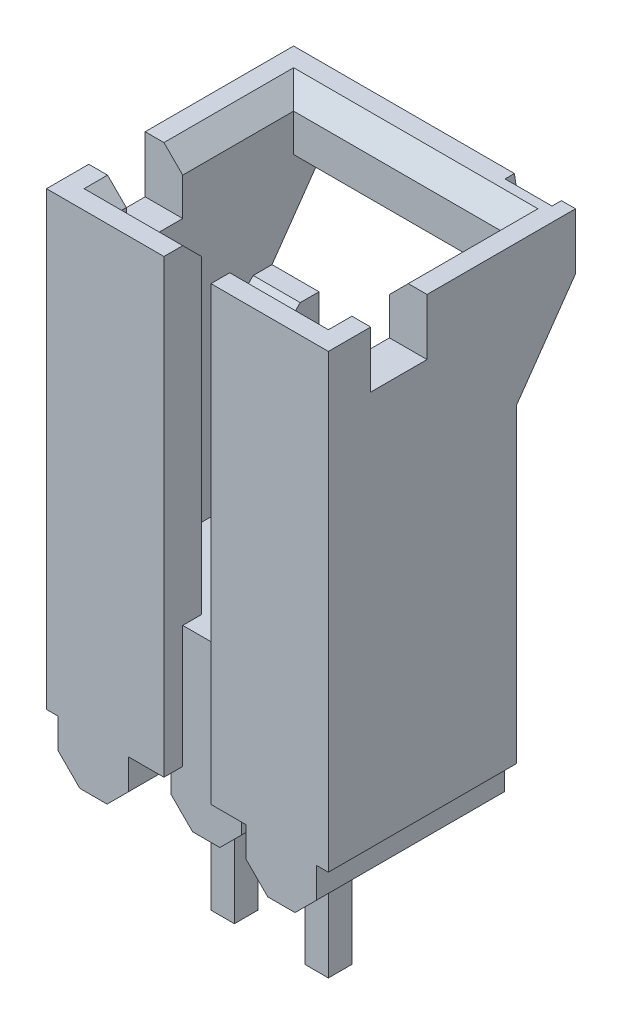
ISO-10303-21;
HEADER;
FILE_DESCRIPTION(('STEP AP214'),'2;1');
FILE_NAME('part.step','',(''),(''),'','','');
FILE_SCHEMA(('AUTOMOTIVE_DESIGN { 1 0 10303 214 1 1 1 1 }'));
ENDSEC;
DATA;
#1=APPLICATION_CONTEXT('core data for automotive mechanical design processes');
#2=APPLICATION_PROTOCOL_DEFINITION('international standard','automotive_design',2000,#1);
#3=PRODUCT_CONTEXT('',#1,'mechanical');
#4=PRODUCT('Part','Part','',(#3));
#5=PRODUCT_RELATED_PRODUCT_CATEGORY('part','',(#4));
#6=PRODUCT_DEFINITION_FORMATION('','',#4);
#7=PRODUCT_DEFINITION_CONTEXT('part definition',#1,'design');
#8=PRODUCT_DEFINITION('design','',#6,#7);
#9=PRODUCT_DEFINITION_SHAPE('','',#8);
#10=(LENGTH_UNIT() NAMED_UNIT(*) SI_UNIT(.MILLI.,.METRE.));
#11=(NAMED_UNIT(*) PLANE_ANGLE_UNIT() SI_UNIT($,.RADIAN.));
#12=(NAMED_UNIT(*) SI_UNIT($,.STERADIAN.) SOLID_ANGLE_UNIT());
#13=UNCERTAINTY_MEASURE_WITH_UNIT(LENGTH_MEASURE(1.E-05),#10,'distance_accuracy_value','');
#14=(GEOMETRIC_REPRESENTATION_CONTEXT(3) GLOBAL_UNCERTAINTY_ASSIGNED_CONTEXT((#13)) GLOBAL_UNIT_ASSIGNED_CONTEXT((#10,
#11,#12)) REPRESENTATION_CONTEXT('',''));
#15=CARTESIAN_POINT('',(0.,0.,0.));
#16=DIRECTION('',(0.,0.,1.));
#17=DIRECTION('',(1.,0.,0.));
#18=AXIS2_PLACEMENT_3D('',#15,#16,#17);
#19=CARTESIAN_POINT('',(-0.32,0.5842,-2.5375));
#20=DIRECTION('',(-1.,0.,0.));
#21=DIRECTION('',(0.,1.,0.));
#22=AXIS2_PLACEMENT_3D('',#19,#20,#21);
#23=PLANE('',#22);
#24=DIRECTION('',(0.,-1.,0.));
#25=VECTOR('',#24,1.);
#26=CARTESIAN_POINT('',(-0.32,1.397,0.32));
#27=LINE('',#26,#25);
#28=CARTESIAN_POINT('',(-0.32,0.5842,0.320000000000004));
#29=VERTEX_POINT('',#28);
#30=CARTESIAN_POINT('',(-0.32,-3.302,0.320000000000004));
#31=VERTEX_POINT('',#30);
#32=EDGE_CURVE('E567',#29,#31,#27,.T.);
#33=ORIENTED_EDGE('',*,*,#32,.F.);
#34=DIRECTION('',(0.,0.,-1.));
#35=VECTOR('',#34,1.);
#36=CARTESIAN_POINT('',(-0.32,0.5842,-2.5375));
#37=LINE('',#36,#35);
#38=CARTESIAN_POINT('',(-0.32,0.5842,-0.314999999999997));
#39=VERTEX_POINT('',#38);
#40=EDGE_CURVE('E572',#29,#39,#37,.T.);
#41=ORIENTED_EDGE('',*,*,#40,.T.);
#42=DIRECTION('',(0.,1.,0.));
#43=VECTOR('',#42,1.);
#44=CARTESIAN_POINT('',(-0.32,-3.302,-0.314999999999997));
#45=LINE('',#44,#43);
#46=CARTESIAN_POINT('',(-0.32,-3.302,-0.315));
#47=VERTEX_POINT('',#46);
#48=EDGE_CURVE('E582',#47,#39,#45,.T.);
#49=ORIENTED_EDGE('',*,*,#48,.F.);
#50=DIRECTION('',(0.,0.,-1.));
#51=VECTOR('',#50,1.);
#52=CARTESIAN_POINT('',(-0.32,-3.302,0.32));
#53=LINE('',#52,#51);
#54=EDGE_CURVE('E573',#31,#47,#53,.T.);
#55=ORIENTED_EDGE('',*,*,#54,.F.);
#56=EDGE_LOOP('',(#33,#41,#49,#55));
#57=FACE_BOUND('',#56,.T.);
#58=ADVANCED_FACE('F14',(#57),#23,.T.);
#59=CARTESIAN_POINT('',(0.315,1.397,0.32));
#60=DIRECTION('',(0.,0.,1.));
#61=DIRECTION('',(0.,-1.,0.));
#62=AXIS2_PLACEMENT_3D('',#59,#60,#61);
#63=PLANE('',#62);
#64=DIRECTION('',(1.,0.,0.));
#65=VECTOR('',#64,1.);
#66=CARTESIAN_POINT('',(0.315,1.397,0.32));
#67=LINE('',#66,#65);
#68=CARTESIAN_POINT('',(0.315,1.397,0.320000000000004));
#69=VERTEX_POINT('',#68);
#70=CARTESIAN_POINT('',(-0.32,1.397,0.320000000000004));
#71=VERTEX_POINT('',#70);
#72=EDGE_CURVE('E550',#69,#71,#67,.F.);
#73=ORIENTED_EDGE('',*,*,#72,.T.);
#74=DIRECTION('',(0.,-1.,0.));
#75=VECTOR('',#74,1.);
#76=CARTESIAN_POINT('',(-0.32,1.397,0.32));
#77=LINE('',#76,#75);
#78=EDGE_CURVE('E540',#71,#29,#77,.T.);
#79=ORIENTED_EDGE('',*,*,#78,.T.);
#80=ORIENTED_EDGE('',*,*,#32,.T.);
#81=DIRECTION('',(-1.,0.,0.));
#82=VECTOR('',#81,1.);
#83=CARTESIAN_POINT('',(0.315,-3.302,0.32));
#84=LINE('',#83,#82);
#85=CARTESIAN_POINT('',(0.315,-3.302,0.320000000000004));
#86=VERTEX_POINT('',#85);
#87=EDGE_CURVE('E549',#86,#31,#84,.T.);
#88=ORIENTED_EDGE('',*,*,#87,.F.);
#89=DIRECTION('',(0.,-1.,0.));
#90=VECTOR('',#89,1.);
#91=CARTESIAN_POINT('',(0.315,1.397,0.320000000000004));
#92=LINE('',#91,#90);
#93=CARTESIAN_POINT('',(0.315,0.5842,0.320000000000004));
#94=VERTEX_POINT('',#93);
#95=EDGE_CURVE('E581',#94,#86,#92,.T.);
#96=ORIENTED_EDGE('',*,*,#95,.F.);
#97=DIRECTION('',(0.,-1.,0.));
#98=VECTOR('',#97,1.);
#99=CARTESIAN_POINT('',(0.315,1.397,0.32));
#100=LINE('',#99,#98);
#101=EDGE_CURVE('E565',#94,#69,#100,.F.);
#102=ORIENTED_EDGE('',*,*,#101,.T.);
#103=EDGE_LOOP('',(#73,#79,#80,#88,#96,#102));
#104=FACE_BOUND('',#103,.T.);
#105=ADVANCED_FACE('F563',(#104),#63,.T.);
#106=CARTESIAN_POINT('',(0.315,-3.302,0.32));
#107=DIRECTION('',(0.,-1.,0.));
#108=DIRECTION('',(-1.,0.,0.));
#109=AXIS2_PLACEMENT_3D('',#106,#107,#108);
#110=PLANE('',#109);
#111=DIRECTION('',(1.,0.,0.));
#112=VECTOR('',#111,1.);
#113=CARTESIAN_POINT('',(0.315,-3.302,-0.314999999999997));
#114=LINE('',#113,#112);
#115=CARTESIAN_POINT('',(0.315,-3.302,-0.315));
#116=VERTEX_POINT('',#115);
#117=EDGE_CURVE('E585',#116,#47,#114,.F.);
#118=ORIENTED_EDGE('',*,*,#117,.F.);
#119=DIRECTION('',(0.,0.,-1.));
#120=VECTOR('',#119,1.);
#121=CARTESIAN_POINT('',(0.315,-3.302,-2.5375));
#122=LINE('',#121,#120);
#123=EDGE_CURVE('E596',#86,#116,#122,.T.);
#124=ORIENTED_EDGE('',*,*,#123,.F.);
#125=ORIENTED_EDGE('',*,*,#87,.T.);
#126=ORIENTED_EDGE('',*,*,#54,.T.);
#127=EDGE_LOOP('',(#118,#124,#125,#126));
#128=FACE_BOUND('',#127,.T.);
#129=ADVANCED_FACE('F1936',(#128),#110,.T.);
#130=CARTESIAN_POINT('',(0.315,-3.302,-0.314999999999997));
#131=DIRECTION('',(0.,0.,-1.));
#132=DIRECTION('',(0.,1.,0.));
#133=AXIS2_PLACEMENT_3D('',#130,#131,#132);
#134=PLANE('',#133);
#135=ORIENTED_EDGE('',*,*,#48,.T.);
#136=DIRECTION('',(0.,1.,0.));
#137=VECTOR('',#136,1.);
#138=CARTESIAN_POINT('',(-0.32,-3.302,-0.314999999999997));
#139=LINE('',#138,#137);
#140=CARTESIAN_POINT('',(-0.32,1.397,-0.315));
#141=VERTEX_POINT('',#140);
#142=EDGE_CURVE('E578',#39,#141,#139,.T.);
#143=ORIENTED_EDGE('',*,*,#142,.T.);
#144=DIRECTION('',(1.,0.,0.));
#145=VECTOR('',#144,1.);
#146=CARTESIAN_POINT('',(0.315,1.397,-0.314999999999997));
#147=LINE('',#146,#145);
#148=CARTESIAN_POINT('',(0.315,1.397,-0.315));
#149=VERTEX_POINT('',#148);
#150=EDGE_CURVE('E575',#141,#149,#147,.T.);
#151=ORIENTED_EDGE('',*,*,#150,.T.);
#152=DIRECTION('',(0.,1.,0.));
#153=VECTOR('',#152,1.);
#154=CARTESIAN_POINT('',(0.315,-3.302,-0.314999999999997));
#155=LINE('',#154,#153);
#156=CARTESIAN_POINT('',(0.315,0.5842,-0.314999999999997));
#157=VERTEX_POINT('',#156);
#158=EDGE_CURVE('E588',#149,#157,#155,.F.);
#159=ORIENTED_EDGE('',*,*,#158,.T.);
#160=DIRECTION('',(0.,-1.,0.));
#161=VECTOR('',#160,1.);
#162=CARTESIAN_POINT('',(0.315,1.397,-0.315));
#163=LINE('',#162,#161);
#164=EDGE_CURVE('E592',#116,#157,#163,.F.);
#165=ORIENTED_EDGE('',*,*,#164,.F.);
#166=ORIENTED_EDGE('',*,*,#117,.T.);
#167=EDGE_LOOP('',(#135,#143,#151,#159,#165,#166));
#168=FACE_BOUND('',#167,.T.);
#169=ADVANCED_FACE('F1928',(#168),#134,.T.);
#170=CARTESIAN_POINT('',(0.315,1.397,-2.5375));
#171=DIRECTION('',(1.,0.,0.));
#172=DIRECTION('',(0.,-1.,0.));
#173=AXIS2_PLACEMENT_3D('',#170,#171,#172);
#174=PLANE('',#173);
#175=ORIENTED_EDGE('',*,*,#164,.T.);
#176=DIRECTION('',(0.,0.,-1.));
#177=VECTOR('',#176,1.);
#178=CARTESIAN_POINT('',(0.315,0.5842,-2.5375));
#179=LINE('',#178,#177);
#180=EDGE_CURVE('E604',#157,#94,#179,.F.);
#181=ORIENTED_EDGE('',*,*,#180,.T.);
#182=ORIENTED_EDGE('',*,*,#95,.T.);
#183=ORIENTED_EDGE('',*,*,#123,.T.);
#184=EDGE_LOOP('',(#175,#181,#182,#183));
#185=FACE_BOUND('',#184,.T.);
#186=ADVANCED_FACE('F1920',(#185),#174,.T.);
#187=CARTESIAN_POINT('',(2.855,-3.302,-0.314999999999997));
#188=DIRECTION('',(0.,0.,-1.));
#189=DIRECTION('',(0.,1.,0.));
#190=AXIS2_PLACEMENT_3D('',#187,#188,#189);
#191=PLANE('',#190);
#192=DIRECTION('',(0.,1.,0.));
#193=VECTOR('',#192,1.);
#194=CARTESIAN_POINT('',(2.22,0.5842,-0.315));
#195=LINE('',#194,#193);
#196=CARTESIAN_POINT('',(2.22,0.5842,-0.314999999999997));
#197=VERTEX_POINT('',#196);
#198=CARTESIAN_POINT('',(2.22,-3.302,-0.315));
#199=VERTEX_POINT('',#198);
#200=EDGE_CURVE('E611',#197,#199,#195,.F.);
#201=ORIENTED_EDGE('',*,*,#200,.F.);
#202=DIRECTION('',(0.,1.,0.));
#203=VECTOR('',#202,1.);
#204=CARTESIAN_POINT('',(2.22,-3.302,-0.314999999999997));
#205=LINE('',#204,#203);
#206=CARTESIAN_POINT('',(2.22,1.397,-0.315));
#207=VERTEX_POINT('',#206);
#208=EDGE_CURVE('E601',#197,#207,#205,.T.);
#209=ORIENTED_EDGE('',*,*,#208,.T.);
#210=DIRECTION('',(1.,0.,0.));
#211=VECTOR('',#210,1.);
#212=CARTESIAN_POINT('',(2.855,1.397,-0.314999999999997));
#213=LINE('',#212,#211);
#214=CARTESIAN_POINT('',(2.855,1.397,-0.315));
#215=VERTEX_POINT('',#214);
#216=EDGE_CURVE('E595',#207,#215,#213,.T.);
#217=ORIENTED_EDGE('',*,*,#216,.T.);
#218=DIRECTION('',(0.,1.,0.));
#219=VECTOR('',#218,1.);
#220=CARTESIAN_POINT('',(2.855,-3.302,-0.314999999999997));
#221=LINE('',#220,#219);
#222=CARTESIAN_POINT('',(2.855,0.5842,-0.314999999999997));
#223=VERTEX_POINT('',#222);
#224=EDGE_CURVE('E605',#215,#223,#221,.F.);
#225=ORIENTED_EDGE('',*,*,#224,.T.);
#226=DIRECTION('',(0.,-1.,0.));
#227=VECTOR('',#226,1.);
#228=CARTESIAN_POINT('',(2.855,1.397,-0.315));
#229=LINE('',#228,#227);
#230=CARTESIAN_POINT('',(2.855,-3.302,-0.315));
#231=VERTEX_POINT('',#230);
#232=EDGE_CURVE('E631',#231,#223,#229,.F.);
#233=ORIENTED_EDGE('',*,*,#232,.F.);
#234=DIRECTION('',(-1.,0.,0.));
#235=VECTOR('',#234,1.);
#236=CARTESIAN_POINT('',(2.855,-3.302,-0.314999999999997));
#237=LINE('',#236,#235);
#238=EDGE_CURVE('E623',#199,#231,#237,.F.);
#239=ORIENTED_EDGE('',*,*,#238,.F.);
#240=EDGE_LOOP('',(#201,#209,#217,#225,#233,#239));
#241=FACE_BOUND('',#240,.T.);
#242=ADVANCED_FACE('F1912',(#241),#191,.T.);
#243=CARTESIAN_POINT('',(0.315,0.5842,-2.5375));
#244=DIRECTION('',(0.707106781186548,0.707106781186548,0.));
#245=DIRECTION('',(0.707106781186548,-0.707106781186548,0.));
#246=AXIS2_PLACEMENT_3D('',#243,#244,#245);
#247=PLANE('',#246);
#248=DIRECTION('',(0.707106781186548,-0.707106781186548,0.));
#249=VECTOR('',#248,1.);
#250=CARTESIAN_POINT('',(0.315,0.5842,-2.5375));
#251=LINE('',#250,#249);
#252=CARTESIAN_POINT('',(0.8992,0.,-2.5375));
#253=VERTEX_POINT('',#252);
#254=CARTESIAN_POINT('',(0.315,0.5842,-2.5375));
#255=VERTEX_POINT('',#254);
#256=EDGE_CURVE('E609',#253,#255,#251,.F.);
#257=ORIENTED_EDGE('',*,*,#256,.F.);
#258=DIRECTION('',(0.,0.,-1.));
#259=VECTOR('',#258,1.);
#260=CARTESIAN_POINT('',(0.8992,0.,2.5425));
#261=LINE('',#260,#259);
#262=CARTESIAN_POINT('',(0.8992,0.,2.0345));
#263=VERTEX_POINT('',#262);
#264=EDGE_CURVE('E630',#263,#253,#261,.T.);
#265=ORIENTED_EDGE('',*,*,#264,.F.);
#266=DIRECTION('',(0.707106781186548,-0.707106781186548,0.));
#267=VECTOR('',#266,1.);
#268=CARTESIAN_POINT('',(0.315,0.5842,2.0345));
#269=LINE('',#268,#267);
#270=CARTESIAN_POINT('',(0.315,0.5842,2.0345));
#271=VERTEX_POINT('',#270);
#272=EDGE_CURVE('E612',#271,#263,#269,.T.);
#273=ORIENTED_EDGE('',*,*,#272,.F.);
#274=DIRECTION('',(0.,0.,-1.));
#275=VECTOR('',#274,1.);
#276=CARTESIAN_POINT('',(0.315,0.5842,-2.5375));
#277=LINE('',#276,#275);
#278=EDGE_CURVE('E614',#94,#271,#277,.F.);
#279=ORIENTED_EDGE('',*,*,#278,.F.);
#280=ORIENTED_EDGE('',*,*,#180,.F.);
#281=DIRECTION('',(0.,0.,-1.));
#282=VECTOR('',#281,1.);
#283=CARTESIAN_POINT('',(0.315,0.5842,-2.5375));
#284=LINE('',#283,#282);
#285=EDGE_CURVE('E639',#157,#255,#284,.T.);
#286=ORIENTED_EDGE('',*,*,#285,.T.);
#287=EDGE_LOOP('',(#257,#265,#273,#279,#280,#286));
#288=FACE_BOUND('',#287,.T.);
#289=ADVANCED_FACE('F1904',(#288),#247,.F.);
#290=CARTESIAN_POINT('',(2.22,0.5842,-2.5375));
#291=DIRECTION('',(-1.,0.,0.));
#292=DIRECTION('',(0.,1.,0.));
#293=AXIS2_PLACEMENT_3D('',#290,#291,#292);
#294=PLANE('',#293);
#295=DIRECTION('',(0.,-1.,0.));
#296=VECTOR('',#295,1.);
#297=CARTESIAN_POINT('',(2.22,1.397,0.32));
#298=LINE('',#297,#296);
#299=CARTESIAN_POINT('',(2.22,0.5842,0.320000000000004));
#300=VERTEX_POINT('',#299);
#301=CARTESIAN_POINT('',(2.22,-3.302,0.320000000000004));
#302=VERTEX_POINT('',#301);
#303=EDGE_CURVE('E652',#300,#302,#298,.T.);
#304=ORIENTED_EDGE('',*,*,#303,.F.);
#305=DIRECTION('',(0.,0.,-1.));
#306=VECTOR('',#305,1.);
#307=CARTESIAN_POINT('',(2.22,0.5842,-2.5375));
#308=LINE('',#307,#306);
#309=EDGE_CURVE('E618',#300,#197,#308,.T.);
#310=ORIENTED_EDGE('',*,*,#309,.T.);
#311=ORIENTED_EDGE('',*,*,#200,.T.);
#312=DIRECTION('',(0.,0.,-1.));
#313=VECTOR('',#312,1.);
#314=CARTESIAN_POINT('',(2.22,-3.302,0.32));
#315=LINE('',#314,#313);
#316=EDGE_CURVE('E621',#302,#199,#315,.T.);
#317=ORIENTED_EDGE('',*,*,#316,.F.);
#318=EDGE_LOOP('',(#304,#310,#311,#317));
#319=FACE_BOUND('',#318,.T.);
#320=ADVANCED_FACE('F1896',(#319),#294,.T.);
#321=CARTESIAN_POINT('',(2.855,-3.302,0.32));
#322=DIRECTION('',(0.,-1.,0.));
#323=DIRECTION('',(-1.,0.,0.));
#324=AXIS2_PLACEMENT_3D('',#321,#322,#323);
#325=PLANE('',#324);
#326=ORIENTED_EDGE('',*,*,#238,.T.);
#327=DIRECTION('',(0.,0.,-1.));
#328=VECTOR('',#327,1.);
#329=CARTESIAN_POINT('',(2.855,-3.302,-2.5375));
#330=LINE('',#329,#328);
#331=CARTESIAN_POINT('',(2.855,-3.302,0.320000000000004));
#332=VERTEX_POINT('',#331);
#333=EDGE_CURVE('E625',#332,#231,#330,.T.);
#334=ORIENTED_EDGE('',*,*,#333,.F.);
#335=DIRECTION('',(1.,0.,0.));
#336=VECTOR('',#335,1.);
#337=CARTESIAN_POINT('',(2.855,-3.302,0.32));
#338=LINE('',#337,#336);
#339=EDGE_CURVE('E662',#302,#332,#338,.T.);
#340=ORIENTED_EDGE('',*,*,#339,.F.);
#341=ORIENTED_EDGE('',*,*,#316,.T.);
#342=EDGE_LOOP('',(#326,#334,#340,#341));
#343=FACE_BOUND('',#342,.T.);
#344=ADVANCED_FACE('F1888',(#343),#325,.T.);
#345=CARTESIAN_POINT('',(2.855,1.397,-2.5375));
#346=DIRECTION('',(1.,0.,0.));
#347=DIRECTION('',(0.,-1.,0.));
#348=AXIS2_PLACEMENT_3D('',#345,#346,#347);
#349=PLANE('',#348);
#350=ORIENTED_EDGE('',*,*,#232,.T.);
#351=DIRECTION('',(0.,0.,-1.));
#352=VECTOR('',#351,1.);
#353=CARTESIAN_POINT('',(2.855,0.5842,-2.5375));
#354=LINE('',#353,#352);
#355=CARTESIAN_POINT('',(2.855,0.5842,0.320000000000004));
#356=VERTEX_POINT('',#355);
#357=EDGE_CURVE('E628',#223,#356,#354,.F.);
#358=ORIENTED_EDGE('',*,*,#357,.T.);
#359=DIRECTION('',(0.,-1.,0.));
#360=VECTOR('',#359,1.);
#361=CARTESIAN_POINT('',(2.855,1.397,0.32));
#362=LINE('',#361,#360);
#363=EDGE_CURVE('E659',#332,#356,#362,.F.);
#364=ORIENTED_EDGE('',*,*,#363,.F.);
#365=ORIENTED_EDGE('',*,*,#333,.T.);
#366=EDGE_LOOP('',(#350,#358,#364,#365));
#367=FACE_BOUND('',#366,.T.);
#368=ADVANCED_FACE('F1880',(#367),#349,.T.);
#369=CARTESIAN_POINT('',(4.1758,0.,2.5425));
#370=DIRECTION('',(0.,-1.,0.));
#371=DIRECTION('',(-1.,0.,0.));
#372=AXIS2_PLACEMENT_3D('',#369,#370,#371);
#373=PLANE('',#372);
#374=DIRECTION('',(0.,0.,-1.));
#375=VECTOR('',#374,1.);
#376=CARTESIAN_POINT('',(1.6358,0.,-2.5375));
#377=LINE('',#376,#375);
#378=CARTESIAN_POINT('',(1.6358,0.,-2.5375));
#379=VERTEX_POINT('',#378);
#380=CARTESIAN_POINT('',(1.6358,0.,2.0345));
#381=VERTEX_POINT('',#380);
#382=EDGE_CURVE('E670',#379,#381,#377,.F.);
#383=ORIENTED_EDGE('',*,*,#382,.T.);
#384=DIRECTION('',(-1.,0.,0.));
#385=VECTOR('',#384,1.);
#386=CARTESIAN_POINT('',(4.1758,0.,2.0345));
#387=LINE('',#386,#385);
#388=EDGE_CURVE('E636',#381,#263,#387,.T.);
#389=ORIENTED_EDGE('',*,*,#388,.T.);
#390=ORIENTED_EDGE('',*,*,#264,.T.);
#391=DIRECTION('',(-1.,0.,0.));
#392=VECTOR('',#391,1.);
#393=CARTESIAN_POINT('',(4.1758,0.,-2.5375));
#394=LINE('',#393,#392);
#395=EDGE_CURVE('E640',#253,#379,#394,.F.);
#396=ORIENTED_EDGE('',*,*,#395,.T.);
#397=EDGE_LOOP('',(#383,#389,#390,#396));
#398=FACE_BOUND('',#397,.T.);
#399=ADVANCED_FACE('F1872',(#398),#373,.T.);
#400=CARTESIAN_POINT('',(0.315,1.397,-2.5375));
#401=DIRECTION('',(1.,0.,0.));
#402=DIRECTION('',(0.,-1.,0.));
#403=AXIS2_PLACEMENT_3D('',#400,#401,#402);
#404=PLANE('',#403);
#405=DIRECTION('',(0.,-1.,0.));
#406=VECTOR('',#405,1.);
#407=CARTESIAN_POINT('',(0.315,1.397,-2.5375));
#408=LINE('',#407,#406);
#409=CARTESIAN_POINT('',(0.315,1.397,-2.5375));
#410=VERTEX_POINT('',#409);
#411=EDGE_CURVE('E645',#255,#410,#408,.F.);
#412=ORIENTED_EDGE('',*,*,#411,.F.);
#413=ORIENTED_EDGE('',*,*,#285,.F.);
#414=ORIENTED_EDGE('',*,*,#158,.F.);
#415=DIRECTION('',(0.,0.,-1.));
#416=VECTOR('',#415,1.);
#417=CARTESIAN_POINT('',(0.315,1.397,-2.5375));
#418=LINE('',#417,#416);
#419=EDGE_CURVE('E669',#149,#410,#418,.T.);
#420=ORIENTED_EDGE('',*,*,#419,.T.);
#421=EDGE_LOOP('',(#412,#413,#414,#420));
#422=FACE_BOUND('',#421,.T.);
#423=ADVANCED_FACE('F1864',(#422),#404,.F.);
#424=CARTESIAN_POINT('',(0.315,1.397,-2.5375));
#425=DIRECTION('',(1.,0.,0.));
#426=DIRECTION('',(0.,-1.,0.));
#427=AXIS2_PLACEMENT_3D('',#424,#425,#426);
#428=PLANE('',#427);
#429=DIRECTION('',(0.,-1.,0.));
#430=VECTOR('',#429,1.);
#431=CARTESIAN_POINT('',(0.315,1.397,2.0345));
#432=LINE('',#431,#430);
#433=CARTESIAN_POINT('',(0.315,1.397,2.0345));
#434=VERTEX_POINT('',#433);
#435=EDGE_CURVE('E647',#434,#271,#432,.T.);
#436=ORIENTED_EDGE('',*,*,#435,.F.);
#437=DIRECTION('',(0.,0.,-1.));
#438=VECTOR('',#437,1.);
#439=CARTESIAN_POINT('',(0.315,1.397,-2.5375));
#440=LINE('',#439,#438);
#441=EDGE_CURVE('E678',#434,#69,#440,.T.);
#442=ORIENTED_EDGE('',*,*,#441,.T.);
#443=ORIENTED_EDGE('',*,*,#101,.F.);
#444=ORIENTED_EDGE('',*,*,#278,.T.);
#445=EDGE_LOOP('',(#436,#442,#443,#444));
#446=FACE_BOUND('',#445,.T.);
#447=ADVANCED_FACE('F1856',(#446),#428,.F.);
#448=CARTESIAN_POINT('',(2.855,1.397,0.32));
#449=DIRECTION('',(0.,0.,1.));
#450=DIRECTION('',(0.,-1.,0.));
#451=AXIS2_PLACEMENT_3D('',#448,#449,#450);
#452=PLANE('',#451);
#453=DIRECTION('',(1.,0.,0.));
#454=VECTOR('',#453,1.);
#455=CARTESIAN_POINT('',(2.855,1.397,0.32));
#456=LINE('',#455,#454);
#457=CARTESIAN_POINT('',(2.855,1.397,0.320000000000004));
#458=VERTEX_POINT('',#457);
#459=CARTESIAN_POINT('',(2.22,1.397,0.320000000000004));
#460=VERTEX_POINT('',#459);
#461=EDGE_CURVE('E653',#458,#460,#456,.F.);
#462=ORIENTED_EDGE('',*,*,#461,.T.);
#463=DIRECTION('',(0.,1.,0.));
#464=VECTOR('',#463,1.);
#465=CARTESIAN_POINT('',(2.22,0.5842,0.320000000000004));
#466=LINE('',#465,#464);
#467=EDGE_CURVE('E680',#460,#300,#466,.F.);
#468=ORIENTED_EDGE('',*,*,#467,.T.);
#469=ORIENTED_EDGE('',*,*,#303,.T.);
#470=ORIENTED_EDGE('',*,*,#339,.T.);
#471=ORIENTED_EDGE('',*,*,#363,.T.);
#472=DIRECTION('',(0.,-1.,0.));
#473=VECTOR('',#472,1.);
#474=CARTESIAN_POINT('',(2.855,1.397,0.32));
#475=LINE('',#474,#473);
#476=EDGE_CURVE('E656',#356,#458,#475,.F.);
#477=ORIENTED_EDGE('',*,*,#476,.T.);
#478=EDGE_LOOP('',(#462,#468,#469,#470,#471,#477));
#479=FACE_BOUND('',#478,.T.);
#480=ADVANCED_FACE('F1848',(#479),#452,.T.);
#481=CARTESIAN_POINT('',(1.6358,0.,-2.5375));
#482=DIRECTION('',(-0.707106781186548,0.707106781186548,0.));
#483=DIRECTION('',(0.707106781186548,0.707106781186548,0.));
#484=AXIS2_PLACEMENT_3D('',#481,#482,#483);
#485=PLANE('',#484);
#486=DIRECTION('',(0.707106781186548,0.707106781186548,0.));
#487=VECTOR('',#486,1.);
#488=CARTESIAN_POINT('',(1.6358,0.,2.0345));
#489=LINE('',#488,#487);
#490=CARTESIAN_POINT('',(2.22,0.5842,2.0345));
#491=VERTEX_POINT('',#490);
#492=EDGE_CURVE('E667',#381,#491,#489,.T.);
#493=ORIENTED_EDGE('',*,*,#492,.F.);
#494=ORIENTED_EDGE('',*,*,#382,.F.);
#495=DIRECTION('',(0.707106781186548,0.707106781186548,0.));
#496=VECTOR('',#495,1.);
#497=CARTESIAN_POINT('',(1.6358,0.,-2.5375));
#498=LINE('',#497,#496);
#499=CARTESIAN_POINT('',(2.22,0.584199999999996,-2.5375));
#500=VERTEX_POINT('',#499);
#501=EDGE_CURVE('E655',#500,#379,#498,.F.);
#502=ORIENTED_EDGE('',*,*,#501,.F.);
#503=DIRECTION('',(0.,0.,-1.));
#504=VECTOR('',#503,1.);
#505=CARTESIAN_POINT('',(2.22,0.5842,-2.5375));
#506=LINE('',#505,#504);
#507=EDGE_CURVE('E694',#500,#197,#506,.F.);
#508=ORIENTED_EDGE('',*,*,#507,.T.);
#509=ORIENTED_EDGE('',*,*,#309,.F.);
#510=DIRECTION('',(0.,0.,-1.));
#511=VECTOR('',#510,1.);
#512=CARTESIAN_POINT('',(2.22,0.5842,-2.5375));
#513=LINE('',#512,#511);
#514=EDGE_CURVE('E689',#300,#491,#513,.F.);
#515=ORIENTED_EDGE('',*,*,#514,.T.);
#516=EDGE_LOOP('',(#493,#494,#502,#508,#509,#515));
#517=FACE_BOUND('',#516,.T.);
#518=ADVANCED_FACE('F1840',(#517),#485,.F.);
#519=CARTESIAN_POINT('',(2.22,1.397,-2.5375));
#520=DIRECTION('',(0.,1.,0.));
#521=DIRECTION('',(1.,0.,0.));
#522=AXIS2_PLACEMENT_3D('',#519,#520,#521);
#523=PLANE('',#522);
#524=ORIENTED_EDGE('',*,*,#419,.F.);
#525=ORIENTED_EDGE('',*,*,#150,.F.);
#526=DIRECTION('',(0.,0.,-1.));
#527=VECTOR('',#526,1.);
#528=CARTESIAN_POINT('',(-0.32,1.397,-2.5375));
#529=LINE('',#528,#527);
#530=CARTESIAN_POINT('',(-0.32,1.397,-2.5375));
#531=VERTEX_POINT('',#530);
#532=EDGE_CURVE('E697',#141,#531,#529,.T.);
#533=ORIENTED_EDGE('',*,*,#532,.T.);
#534=DIRECTION('',(1.,0.,0.));
#535=VECTOR('',#534,1.);
#536=CARTESIAN_POINT('',(2.22,1.397,-2.5375));
#537=LINE('',#536,#535);
#538=EDGE_CURVE('E674',#410,#531,#537,.F.);
#539=ORIENTED_EDGE('',*,*,#538,.F.);
#540=EDGE_LOOP('',(#524,#525,#533,#539));
#541=FACE_BOUND('',#540,.T.);
#542=ADVANCED_FACE('F1833',(#541),#523,.F.);
#543=CARTESIAN_POINT('',(2.22,1.397,-2.5375));
#544=DIRECTION('',(0.,1.,0.));
#545=DIRECTION('',(1.,0.,0.));
#546=AXIS2_PLACEMENT_3D('',#543,#544,#545);
#547=PLANE('',#546);
#548=ORIENTED_EDGE('',*,*,#441,.F.);
#549=DIRECTION('',(1.,0.,0.));
#550=VECTOR('',#549,1.);
#551=CARTESIAN_POINT('',(2.22,1.397,2.0345));
#552=LINE('',#551,#550);
#553=CARTESIAN_POINT('',(0.6325,1.397,2.0345));
#554=VERTEX_POINT('',#553);
#555=EDGE_CURVE('E681',#554,#434,#552,.F.);
#556=ORIENTED_EDGE('',*,*,#555,.F.);
#557=DIRECTION('',(0.,0.,-1.));
#558=VECTOR('',#557,1.);
#559=CARTESIAN_POINT('',(0.6325,1.397,-2.5375));
#560=LINE('',#559,#558);
#561=CARTESIAN_POINT('',(0.6325,1.397,2.5425));
#562=VERTEX_POINT('',#561);
#563=EDGE_CURVE('E683',#562,#554,#560,.T.);
#564=ORIENTED_EDGE('',*,*,#563,.F.);
#565=DIRECTION('',(1.,0.,0.));
#566=VECTOR('',#565,1.);
#567=CARTESIAN_POINT('',(2.22,1.397,2.5425));
#568=LINE('',#567,#566);
#569=CARTESIAN_POINT('',(-0.32,1.397,2.5425));
#570=VERTEX_POINT('',#569);
#571=EDGE_CURVE('E558',#570,#562,#568,.T.);
#572=ORIENTED_EDGE('',*,*,#571,.F.);
#573=DIRECTION('',(0.,0.,-1.));
#574=VECTOR('',#573,1.);
#575=CARTESIAN_POINT('',(-0.32,1.397,-2.5375));
#576=LINE('',#575,#574);
#577=EDGE_CURVE('E544',#570,#71,#576,.T.);
#578=ORIENTED_EDGE('',*,*,#577,.T.);
#579=ORIENTED_EDGE('',*,*,#72,.F.);
#580=EDGE_LOOP('',(#548,#556,#564,#572,#578,#579));
#581=FACE_BOUND('',#580,.T.);
#582=ADVANCED_FACE('F555',(#581),#547,.F.);
#583=CARTESIAN_POINT('',(2.22,0.5842,-2.5375));
#584=DIRECTION('',(-1.,0.,0.));
#585=DIRECTION('',(0.,1.,0.));
#586=AXIS2_PLACEMENT_3D('',#583,#584,#585);
#587=PLANE('',#586);
#588=DIRECTION('',(0.,1.,0.));
#589=VECTOR('',#588,1.);
#590=CARTESIAN_POINT('',(2.22,0.5842,2.0345));
#591=LINE('',#590,#589);
#592=CARTESIAN_POINT('',(2.22,1.397,2.0345));
#593=VERTEX_POINT('',#592);
#594=EDGE_CURVE('E686',#491,#593,#591,.T.);
#595=ORIENTED_EDGE('',*,*,#594,.F.);
#596=ORIENTED_EDGE('',*,*,#514,.F.);
#597=ORIENTED_EDGE('',*,*,#467,.F.);
#598=DIRECTION('',(0.,0.,-1.));
#599=VECTOR('',#598,1.);
#600=CARTESIAN_POINT('',(2.22,1.397,-2.5375));
#601=LINE('',#600,#599);
#602=EDGE_CURVE('E559',#460,#593,#601,.F.);
#603=ORIENTED_EDGE('',*,*,#602,.T.);
#604=EDGE_LOOP('',(#595,#596,#597,#603));
#605=FACE_BOUND('',#604,.T.);
#606=ADVANCED_FACE('F1818',(#605),#587,.F.);
#607=CARTESIAN_POINT('',(2.22,0.5842,-2.5375));
#608=DIRECTION('',(-1.,0.,0.));
#609=DIRECTION('',(0.,1.,0.));
#610=AXIS2_PLACEMENT_3D('',#607,#608,#609);
#611=PLANE('',#610);
#612=DIRECTION('',(0.,1.,0.));
#613=VECTOR('',#612,1.);
#614=CARTESIAN_POINT('',(2.22,0.5842,-2.5375));
#615=LINE('',#614,#613);
#616=CARTESIAN_POINT('',(2.22,1.397,-2.5375));
#617=VERTEX_POINT('',#616);
#618=EDGE_CURVE('E688',#617,#500,#615,.F.);
#619=ORIENTED_EDGE('',*,*,#618,.F.);
#620=DIRECTION('',(0.,0.,-1.));
#621=VECTOR('',#620,1.);
#622=CARTESIAN_POINT('',(2.22,1.397,-2.5375));
#623=LINE('',#622,#621);
#624=EDGE_CURVE('E713',#617,#207,#623,.F.);
#625=ORIENTED_EDGE('',*,*,#624,.T.);
#626=ORIENTED_EDGE('',*,*,#208,.F.);
#627=ORIENTED_EDGE('',*,*,#507,.F.);
#628=EDGE_LOOP('',(#619,#625,#626,#627));
#629=FACE_BOUND('',#628,.T.);
#630=ADVANCED_FACE('F1810',(#629),#611,.F.);
#631=CARTESIAN_POINT('',(-0.32,0.5842,-2.5375));
#632=DIRECTION('',(-1.,0.,0.));
#633=DIRECTION('',(0.,1.,0.));
#634=AXIS2_PLACEMENT_3D('',#631,#632,#633);
#635=PLANE('',#634);
#636=DIRECTION('',(0.,1.,0.));
#637=VECTOR('',#636,1.);
#638=CARTESIAN_POINT('',(-0.32,0.5842,-2.5375));
#639=LINE('',#638,#637);
#640=CARTESIAN_POINT('',(-0.32,0.584199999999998,-2.5375));
#641=VERTEX_POINT('',#640);
#642=EDGE_CURVE('E699',#531,#641,#639,.F.);
#643=ORIENTED_EDGE('',*,*,#642,.F.);
#644=ORIENTED_EDGE('',*,*,#532,.F.);
#645=ORIENTED_EDGE('',*,*,#142,.F.);
#646=DIRECTION('',(0.,0.,-1.));
#647=VECTOR('',#646,1.);
#648=CARTESIAN_POINT('',(-0.32,0.5842,-2.5375));
#649=LINE('',#648,#647);
#650=EDGE_CURVE('E716',#39,#641,#649,.T.);
#651=ORIENTED_EDGE('',*,*,#650,.T.);
#652=EDGE_LOOP('',(#643,#644,#645,#651));
#653=FACE_BOUND('',#652,.T.);
#654=ADVANCED_FACE('F1803',(#653),#635,.F.);
#655=CARTESIAN_POINT('',(-0.32,0.5842,-2.5375));
#656=DIRECTION('',(-1.,0.,0.));
#657=DIRECTION('',(0.,1.,0.));
#658=AXIS2_PLACEMENT_3D('',#655,#656,#657);
#659=PLANE('',#658);
#660=DIRECTION('',(0.,1.,0.));
#661=VECTOR('',#660,1.);
#662=CARTESIAN_POINT('',(-0.32,0.5842,2.5425));
#663=LINE('',#662,#661);
#664=CARTESIAN_POINT('',(-0.320000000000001,0.584199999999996,2.5425));
#665=VERTEX_POINT('',#664);
#666=EDGE_CURVE('E560',#665,#570,#663,.T.);
#667=ORIENTED_EDGE('',*,*,#666,.F.);
#668=DIRECTION('',(0.,0.,-1.));
#669=VECTOR('',#668,1.);
#670=CARTESIAN_POINT('',(-0.32,0.5842,-2.5375));
#671=LINE('',#670,#669);
#672=EDGE_CURVE('E546',#665,#29,#671,.T.);
#673=ORIENTED_EDGE('',*,*,#672,.T.);
#674=ORIENTED_EDGE('',*,*,#78,.F.);
#675=ORIENTED_EDGE('',*,*,#577,.F.);
#676=EDGE_LOOP('',(#667,#673,#674,#675));
#677=FACE_BOUND('',#676,.T.);
#678=ADVANCED_FACE('F543',(#677),#659,.F.);
#679=CARTESIAN_POINT('',(2.22,1.397,-2.5375));
#680=DIRECTION('',(0.,1.,0.));
#681=DIRECTION('',(1.,0.,0.));
#682=AXIS2_PLACEMENT_3D('',#679,#680,#681);
#683=PLANE('',#682);
#684=DIRECTION('',(1.,0.,0.));
#685=VECTOR('',#684,1.);
#686=CARTESIAN_POINT('',(2.22,1.397,2.5425));
#687=LINE('',#686,#685);
#688=CARTESIAN_POINT('',(1.9025,1.397,2.5425));
#689=VERTEX_POINT('',#688);
#690=CARTESIAN_POINT('',(2.855,1.397,2.5425));
#691=VERTEX_POINT('',#690);
#692=EDGE_CURVE('E704',#689,#691,#687,.T.);
#693=ORIENTED_EDGE('',*,*,#692,.F.);
#694=DIRECTION('',(0.,0.,-1.));
#695=VECTOR('',#694,1.);
#696=CARTESIAN_POINT('',(1.9025,1.397,-2.5375));
#697=LINE('',#696,#695);
#698=CARTESIAN_POINT('',(1.9025,1.397,2.0345));
#699=VERTEX_POINT('',#698);
#700=EDGE_CURVE('E707',#699,#689,#697,.F.);
#701=ORIENTED_EDGE('',*,*,#700,.F.);
#702=DIRECTION('',(1.,0.,0.));
#703=VECTOR('',#702,1.);
#704=CARTESIAN_POINT('',(2.22,1.397,2.0345));
#705=LINE('',#704,#703);
#706=EDGE_CURVE('E709',#593,#699,#705,.F.);
#707=ORIENTED_EDGE('',*,*,#706,.F.);
#708=ORIENTED_EDGE('',*,*,#602,.F.);
#709=ORIENTED_EDGE('',*,*,#461,.F.);
#710=DIRECTION('',(0.,0.,-1.));
#711=VECTOR('',#710,1.);
#712=CARTESIAN_POINT('',(2.855,1.397,-2.5375));
#713=LINE('',#712,#711);
#714=EDGE_CURVE('E719',#458,#691,#713,.F.);
#715=ORIENTED_EDGE('',*,*,#714,.T.);
#716=EDGE_LOOP('',(#693,#701,#707,#708,#709,#715));
#717=FACE_BOUND('',#716,.T.);
#718=ADVANCED_FACE('F1788',(#717),#683,.F.);
#719=CARTESIAN_POINT('',(2.22,1.397,-2.5375));
#720=DIRECTION('',(0.,1.,0.));
#721=DIRECTION('',(1.,0.,0.));
#722=AXIS2_PLACEMENT_3D('',#719,#720,#721);
#723=PLANE('',#722);
#724=DIRECTION('',(1.,0.,0.));
#725=VECTOR('',#724,1.);
#726=CARTESIAN_POINT('',(2.22,1.397,-2.5375));
#727=LINE('',#726,#725);
#728=CARTESIAN_POINT('',(2.855,1.397,-2.5375));
#729=VERTEX_POINT('',#728);
#730=EDGE_CURVE('E706',#729,#617,#727,.F.);
#731=ORIENTED_EDGE('',*,*,#730,.F.);
#732=DIRECTION('',(0.,0.,-1.));
#733=VECTOR('',#732,1.);
#734=CARTESIAN_POINT('',(2.855,1.397,-2.5375));
#735=LINE('',#734,#733);
#736=EDGE_CURVE('E731',#729,#215,#735,.F.);
#737=ORIENTED_EDGE('',*,*,#736,.T.);
#738=ORIENTED_EDGE('',*,*,#216,.F.);
#739=ORIENTED_EDGE('',*,*,#624,.F.);
#740=EDGE_LOOP('',(#731,#737,#738,#739));
#741=FACE_BOUND('',#740,.T.);
#742=ADVANCED_FACE('F1780',(#741),#723,.F.);
#743=CARTESIAN_POINT('',(-0.9042,0.,-2.5375));
#744=DIRECTION('',(-0.707106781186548,0.707106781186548,0.));
#745=DIRECTION('',(0.707106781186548,0.707106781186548,0.));
#746=AXIS2_PLACEMENT_3D('',#743,#744,#745);
#747=PLANE('',#746);
#748=DIRECTION('',(0.707106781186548,0.707106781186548,0.));
#749=VECTOR('',#748,1.);
#750=CARTESIAN_POINT('',(-0.9042,0.,2.5425));
#751=LINE('',#750,#749);
#752=CARTESIAN_POINT('',(-0.9042,0.,2.5425));
#753=VERTEX_POINT('',#752);
#754=EDGE_CURVE('E720',#753,#665,#751,.T.);
#755=ORIENTED_EDGE('',*,*,#754,.F.);
#756=DIRECTION('',(0.,0.,-1.));
#757=VECTOR('',#756,1.);
#758=CARTESIAN_POINT('',(-0.9042,0.,2.5425));
#759=LINE('',#758,#757);
#760=CARTESIAN_POINT('',(-0.9042,0.,-2.5375));
#761=VERTEX_POINT('',#760);
#762=EDGE_CURVE('E736',#761,#753,#759,.F.);
#763=ORIENTED_EDGE('',*,*,#762,.F.);
#764=DIRECTION('',(0.707106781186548,0.707106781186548,0.));
#765=VECTOR('',#764,1.);
#766=CARTESIAN_POINT('',(-0.9042,0.,-2.5375));
#767=LINE('',#766,#765);
#768=EDGE_CURVE('E722',#641,#761,#767,.F.);
#769=ORIENTED_EDGE('',*,*,#768,.F.);
#770=ORIENTED_EDGE('',*,*,#650,.F.);
#771=ORIENTED_EDGE('',*,*,#40,.F.);
#772=ORIENTED_EDGE('',*,*,#672,.F.);
#773=EDGE_LOOP('',(#755,#763,#769,#770,#771,#772));
#774=FACE_BOUND('',#773,.T.);
#775=ADVANCED_FACE('F1772',(#774),#747,.F.);
#776=CARTESIAN_POINT('',(2.855,1.397,-2.5375));
#777=DIRECTION('',(1.,0.,0.));
#778=DIRECTION('',(0.,-1.,0.));
#779=AXIS2_PLACEMENT_3D('',#776,#777,#778);
#780=PLANE('',#779);
#781=DIRECTION('',(0.,-1.,0.));
#782=VECTOR('',#781,1.);
#783=CARTESIAN_POINT('',(2.855,1.397,2.5425));
#784=LINE('',#783,#782);
#785=CARTESIAN_POINT('',(2.855,0.5842,2.5425));
#786=VERTEX_POINT('',#785);
#787=EDGE_CURVE('E726',#691,#786,#784,.T.);
#788=ORIENTED_EDGE('',*,*,#787,.F.);
#789=ORIENTED_EDGE('',*,*,#714,.F.);
#790=ORIENTED_EDGE('',*,*,#476,.F.);
#791=DIRECTION('',(0.,0.,-1.));
#792=VECTOR('',#791,1.);
#793=CARTESIAN_POINT('',(2.855,0.5842,-2.5375));
#794=LINE('',#793,#792);
#795=EDGE_CURVE('E739',#356,#786,#794,.F.);
#796=ORIENTED_EDGE('',*,*,#795,.T.);
#797=EDGE_LOOP('',(#788,#789,#790,#796));
#798=FACE_BOUND('',#797,.T.);
#799=ADVANCED_FACE('F1764',(#798),#780,.F.);
#800=CARTESIAN_POINT('',(2.855,1.397,-2.5375));
#801=DIRECTION('',(1.,0.,0.));
#802=DIRECTION('',(0.,-1.,0.));
#803=AXIS2_PLACEMENT_3D('',#800,#801,#802);
#804=PLANE('',#803);
#805=DIRECTION('',(0.,-1.,0.));
#806=VECTOR('',#805,1.);
#807=CARTESIAN_POINT('',(2.855,1.397,-2.5375));
#808=LINE('',#807,#806);
#809=CARTESIAN_POINT('',(2.855,0.5842,-2.5375));
#810=VERTEX_POINT('',#809);
#811=EDGE_CURVE('E728',#810,#729,#808,.F.);
#812=ORIENTED_EDGE('',*,*,#811,.F.);
#813=DIRECTION('',(0.,0.,-1.));
#814=VECTOR('',#813,1.);
#815=CARTESIAN_POINT('',(2.855,0.5842,-2.5375));
#816=LINE('',#815,#814);
#817=EDGE_CURVE('E744',#810,#223,#816,.F.);
#818=ORIENTED_EDGE('',*,*,#817,.T.);
#819=ORIENTED_EDGE('',*,*,#224,.F.);
#820=ORIENTED_EDGE('',*,*,#736,.F.);
#821=EDGE_LOOP('',(#812,#818,#819,#820));
#822=FACE_BOUND('',#821,.T.);
#823=ADVANCED_FACE('F1756',(#822),#804,.F.);
#824=CARTESIAN_POINT('',(4.1758,0.,2.5425));
#825=DIRECTION('',(0.,-1.,0.));
#826=DIRECTION('',(-1.,0.,0.));
#827=AXIS2_PLACEMENT_3D('',#824,#825,#826);
#828=PLANE('',#827);
#829=DIRECTION('',(-1.,0.,0.));
#830=VECTOR('',#829,1.);
#831=CARTESIAN_POINT('',(4.1758,0.,-2.5375));
#832=LINE('',#831,#830);
#833=CARTESIAN_POINT('',(-1.6408,0.,-2.5375));
#834=VERTEX_POINT('',#833);
#835=EDGE_CURVE('E740',#834,#761,#832,.F.);
#836=ORIENTED_EDGE('',*,*,#835,.T.);
#837=ORIENTED_EDGE('',*,*,#762,.T.);
#838=DIRECTION('',(-1.,0.,0.));
#839=VECTOR('',#838,1.);
#840=CARTESIAN_POINT('',(4.1758,0.,2.5425));
#841=LINE('',#840,#839);
#842=CARTESIAN_POINT('',(-1.6408,0.,2.5425));
#843=VERTEX_POINT('',#842);
#844=EDGE_CURVE('E734',#753,#843,#841,.T.);
#845=ORIENTED_EDGE('',*,*,#844,.T.);
#846=DIRECTION('',(0.,0.,-1.));
#847=VECTOR('',#846,1.);
#848=CARTESIAN_POINT('',(-1.6408,0.,2.5425));
#849=LINE('',#848,#847);
#850=EDGE_CURVE('E769',#834,#843,#849,.F.);
#851=ORIENTED_EDGE('',*,*,#850,.F.);
#852=EDGE_LOOP('',(#836,#837,#845,#851));
#853=FACE_BOUND('',#852,.T.);
#854=ADVANCED_FACE('F1748',(#853),#828,.T.);
#855=CARTESIAN_POINT('',(2.855,0.5842,-2.5375));
#856=DIRECTION('',(0.707106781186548,0.707106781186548,0.));
#857=DIRECTION('',(0.707106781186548,-0.707106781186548,0.));
#858=AXIS2_PLACEMENT_3D('',#855,#856,#857);
#859=PLANE('',#858);
#860=DIRECTION('',(0.707106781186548,-0.707106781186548,0.));
#861=VECTOR('',#860,1.);
#862=CARTESIAN_POINT('',(2.855,0.5842,-2.5375));
#863=LINE('',#862,#861);
#864=CARTESIAN_POINT('',(3.4392,0.,-2.5375));
#865=VERTEX_POINT('',#864);
#866=EDGE_CURVE('E748',#865,#810,#863,.F.);
#867=ORIENTED_EDGE('',*,*,#866,.F.);
#868=DIRECTION('',(0.,0.,-1.));
#869=VECTOR('',#868,1.);
#870=CARTESIAN_POINT('',(3.4392,0.,2.5425));
#871=LINE('',#870,#869);
#872=CARTESIAN_POINT('',(3.4392,0.,2.5425));
#873=VERTEX_POINT('',#872);
#874=EDGE_CURVE('E777',#873,#865,#871,.T.);
#875=ORIENTED_EDGE('',*,*,#874,.F.);
#876=DIRECTION('',(0.707106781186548,-0.707106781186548,0.));
#877=VECTOR('',#876,1.);
#878=CARTESIAN_POINT('',(2.855,0.5842,2.5425));
#879=LINE('',#878,#877);
#880=EDGE_CURVE('E750',#786,#873,#879,.T.);
#881=ORIENTED_EDGE('',*,*,#880,.F.);
#882=ORIENTED_EDGE('',*,*,#795,.F.);
#883=ORIENTED_EDGE('',*,*,#357,.F.);
#884=ORIENTED_EDGE('',*,*,#817,.F.);
#885=EDGE_LOOP('',(#867,#875,#881,#882,#883,#884));
#886=FACE_BOUND('',#885,.T.);
#887=ADVANCED_FACE('F1740',(#886),#859,.F.);
#888=CARTESIAN_POINT('',(2.855,4.699,-0.314999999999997));
#889=DIRECTION('',(0.,0.,-1.));
#890=DIRECTION('',(0.,1.,0.));
#891=AXIS2_PLACEMENT_3D('',#888,#889,#890);
#892=PLANE('',#891);
#893=DIRECTION('',(0.,-1.,0.));
#894=VECTOR('',#893,1.);
#895=CARTESIAN_POINT('',(2.855,1.397,-0.315));
#896=LINE('',#895,#894);
#897=CARTESIAN_POINT('',(2.855,4.699,-0.315));
#898=VERTEX_POINT('',#897);
#899=CARTESIAN_POINT('',(2.855,10.541,-0.315));
#900=VERTEX_POINT('',#899);
#901=EDGE_CURVE('E782',#898,#900,#896,.F.);
#902=ORIENTED_EDGE('',*,*,#901,.F.);
#903=DIRECTION('',(1.,0.,0.));
#904=VECTOR('',#903,1.);
#905=CARTESIAN_POINT('',(2.855,4.699,-0.314999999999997));
#906=LINE('',#905,#904);
#907=CARTESIAN_POINT('',(2.22,4.699,-0.315));
#908=VERTEX_POINT('',#907);
#909=EDGE_CURVE('E747',#898,#908,#906,.F.);
#910=ORIENTED_EDGE('',*,*,#909,.T.);
#911=DIRECTION('',(0.,1.,0.));
#912=VECTOR('',#911,1.);
#913=CARTESIAN_POINT('',(2.22,0.5842,-0.315));
#914=LINE('',#913,#912);
#915=CARTESIAN_POINT('',(2.22,10.541,-0.315));
#916=VERTEX_POINT('',#915);
#917=EDGE_CURVE('E796',#916,#908,#914,.F.);
#918=ORIENTED_EDGE('',*,*,#917,.F.);
#919=DIRECTION('',(1.,0.,0.));
#920=VECTOR('',#919,1.);
#921=CARTESIAN_POINT('',(2.855,10.541,-0.314999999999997));
#922=LINE('',#921,#920);
#923=EDGE_CURVE('E785',#900,#916,#922,.F.);
#924=ORIENTED_EDGE('',*,*,#923,.F.);
#925=EDGE_LOOP('',(#902,#910,#918,#924));
#926=FACE_BOUND('',#925,.T.);
#927=ADVANCED_FACE('F1732',(#926),#892,.T.);
#928=CARTESIAN_POINT('',(0.315,4.699,-0.314999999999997));
#929=DIRECTION('',(0.,0.,-1.));
#930=DIRECTION('',(0.,1.,0.));
#931=AXIS2_PLACEMENT_3D('',#928,#929,#930);
#932=PLANE('',#931);
#933=DIRECTION('',(0.,-1.,0.));
#934=VECTOR('',#933,1.);
#935=CARTESIAN_POINT('',(0.315,1.397,-0.315));
#936=LINE('',#935,#934);
#937=CARTESIAN_POINT('',(0.315,4.699,-0.315));
#938=VERTEX_POINT('',#937);
#939=CARTESIAN_POINT('',(0.315,10.541,-0.315));
#940=VERTEX_POINT('',#939);
#941=EDGE_CURVE('E801',#938,#940,#936,.F.);
#942=ORIENTED_EDGE('',*,*,#941,.F.);
#943=DIRECTION('',(1.,0.,0.));
#944=VECTOR('',#943,1.);
#945=CARTESIAN_POINT('',(0.315,4.699,-0.314999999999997));
#946=LINE('',#945,#944);
#947=CARTESIAN_POINT('',(-0.32,4.699,-0.315));
#948=VERTEX_POINT('',#947);
#949=EDGE_CURVE('E755',#938,#948,#946,.F.);
#950=ORIENTED_EDGE('',*,*,#949,.T.);
#951=DIRECTION('',(0.,1.,0.));
#952=VECTOR('',#951,1.);
#953=CARTESIAN_POINT('',(-0.32,0.5842,-0.315));
#954=LINE('',#953,#952);
#955=CARTESIAN_POINT('',(-0.32,10.541,-0.315));
#956=VERTEX_POINT('',#955);
#957=EDGE_CURVE('E815',#956,#948,#954,.F.);
#958=ORIENTED_EDGE('',*,*,#957,.F.);
#959=DIRECTION('',(1.,0.,0.));
#960=VECTOR('',#959,1.);
#961=CARTESIAN_POINT('',(0.315,10.541,-0.314999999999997));
#962=LINE('',#961,#960);
#963=EDGE_CURVE('E804',#940,#956,#962,.F.);
#964=ORIENTED_EDGE('',*,*,#963,.F.);
#965=EDGE_LOOP('',(#942,#950,#958,#964));
#966=FACE_BOUND('',#965,.T.);
#967=ADVANCED_FACE('F1724',(#966),#932,.T.);
#968=CARTESIAN_POINT('',(4.6965,13.589,-4.1377));
#969=DIRECTION('',(0.984807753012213,-0.173648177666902,0.));
#970=DIRECTION('',(-0.173648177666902,-0.984807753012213,0.));
#971=AXIS2_PLACEMENT_3D('',#968,#969,#970);
#972=PLANE('',#971);
#973=DIRECTION('',(0.142968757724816,0.810816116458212,-0.567571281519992));
#974=VECTOR('',#973,1.);
#975=CARTESIAN_POINT('',(4.37899999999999,11.788368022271,-3.94405761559));
#976=LINE('',#975,#974);
#977=CARTESIAN_POINT('',(4.37899999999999,11.788368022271,-3.94405761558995));
#978=VERTEX_POINT('',#977);
#979=CARTESIAN_POINT('',(4.42777768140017,12.065,-4.1377));
#980=VERTEX_POINT('',#979);
#981=EDGE_CURVE('E761',#978,#980,#976,.T.);
#982=ORIENTED_EDGE('',*,*,#981,.F.);
#983=DIRECTION('',(0.,0.,-1.));
#984=VECTOR('',#983,1.);
#985=CARTESIAN_POINT('',(4.37899999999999,11.788368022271,-4.1377));
#986=LINE('',#985,#984);
#987=CARTESIAN_POINT('',(4.37899999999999,11.788368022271,-3.8837));
#988=VERTEX_POINT('',#987);
#989=EDGE_CURVE('E763',#988,#978,#986,.T.);
#990=ORIENTED_EDGE('',*,*,#989,.F.);
#991=DIRECTION('',(-0.173648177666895,-0.984807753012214,0.));
#992=VECTOR('',#991,1.);
#993=CARTESIAN_POINT('',(4.6965,13.589,-3.8837));
#994=LINE('',#993,#992);
#995=CARTESIAN_POINT('',(4.6965,13.589,-3.8837));
#996=VERTEX_POINT('',#995);
#997=EDGE_CURVE('E826',#996,#988,#994,.T.);
#998=ORIENTED_EDGE('',*,*,#997,.F.);
#999=DIRECTION('',(0.,0.,-1.));
#1000=VECTOR('',#999,1.);
#1001=CARTESIAN_POINT('',(4.6965,13.589,-4.1377));
#1002=LINE('',#1001,#1000);
#1003=CARTESIAN_POINT('',(4.6965,13.589,-4.1377));
#1004=VERTEX_POINT('',#1003);
#1005=EDGE_CURVE('E757',#1004,#996,#1002,.F.);
#1006=ORIENTED_EDGE('',*,*,#1005,.F.);
#1007=DIRECTION('',(-0.173648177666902,-0.984807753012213,0.));
#1008=VECTOR('',#1007,1.);
#1009=CARTESIAN_POINT('',(4.6965,13.589,-4.1377));
#1010=LINE('',#1009,#1008);
#1011=EDGE_CURVE('E758',#980,#1004,#1010,.F.);
#1012=ORIENTED_EDGE('',*,*,#1011,.F.);
#1013=EDGE_LOOP('',(#982,#990,#998,#1006,#1012));
#1014=FACE_BOUND('',#1013,.T.);
#1015=ADVANCED_FACE('F1716',(#1014),#972,.F.);
#1016=CARTESIAN_POINT('',(-1.6408,0.,2.5425));
#1017=DIRECTION('',(-0.707106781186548,-0.707106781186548,0.));
#1018=DIRECTION('',(-0.707106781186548,0.707106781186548,0.));
#1019=AXIS2_PLACEMENT_3D('',#1016,#1017,#1018);
#1020=PLANE('',#1019);
#1021=ORIENTED_EDGE('',*,*,#850,.T.);
#1022=DIRECTION('',(-0.707106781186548,0.707106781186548,0.));
#1023=VECTOR('',#1022,1.);
#1024=CARTESIAN_POINT('',(-1.6408,0.,2.5425));
#1025=LINE('',#1024,#1023);
#1026=CARTESIAN_POINT('',(-2.225,0.5842,2.5425));
#1027=VERTEX_POINT('',#1026);
#1028=EDGE_CURVE('E766',#843,#1027,#1025,.T.);
#1029=ORIENTED_EDGE('',*,*,#1028,.T.);
#1030=DIRECTION('',(0.,0.,-1.));
#1031=VECTOR('',#1030,1.);
#1032=CARTESIAN_POINT('',(-2.225,0.5842,2.5425));
#1033=LINE('',#1032,#1031);
#1034=CARTESIAN_POINT('',(-2.225,0.5842,-2.5375));
#1035=VERTEX_POINT('',#1034);
#1036=EDGE_CURVE('E834',#1035,#1027,#1033,.F.);
#1037=ORIENTED_EDGE('',*,*,#1036,.F.);
#1038=DIRECTION('',(-0.707106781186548,0.707106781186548,0.));
#1039=VECTOR('',#1038,1.);
#1040=CARTESIAN_POINT('',(-1.6408,0.,-2.5375));
#1041=LINE('',#1040,#1039);
#1042=EDGE_CURVE('E760',#1035,#834,#1041,.F.);
#1043=ORIENTED_EDGE('',*,*,#1042,.T.);
#1044=EDGE_LOOP('',(#1021,#1029,#1037,#1043));
#1045=FACE_BOUND('',#1044,.T.);
#1046=ADVANCED_FACE('F1708',(#1045),#1020,.T.);
#1047=CARTESIAN_POINT('',(4.1758,0.,2.5425));
#1048=DIRECTION('',(0.,-1.,0.));
#1049=DIRECTION('',(-1.,0.,0.));
#1050=AXIS2_PLACEMENT_3D('',#1047,#1048,#1049);
#1051=PLANE('',#1050);
#1052=ORIENTED_EDGE('',*,*,#874,.T.);
#1053=DIRECTION('',(-1.,0.,0.));
#1054=VECTOR('',#1053,1.);
#1055=CARTESIAN_POINT('',(4.1758,0.,-2.5375));
#1056=LINE('',#1055,#1054);
#1057=CARTESIAN_POINT('',(4.1758,0.,-2.5375));
#1058=VERTEX_POINT('',#1057);
#1059=EDGE_CURVE('E774',#865,#1058,#1056,.F.);
#1060=ORIENTED_EDGE('',*,*,#1059,.T.);
#1061=DIRECTION('',(0.,0.,-1.));
#1062=VECTOR('',#1061,1.);
#1063=CARTESIAN_POINT('',(4.1758,0.,2.5425));
#1064=LINE('',#1063,#1062);
#1065=CARTESIAN_POINT('',(4.1758,0.,2.5425));
#1066=VERTEX_POINT('',#1065);
#1067=EDGE_CURVE('E862',#1066,#1058,#1064,.T.);
#1068=ORIENTED_EDGE('',*,*,#1067,.F.);
#1069=DIRECTION('',(-1.,0.,0.));
#1070=VECTOR('',#1069,1.);
#1071=CARTESIAN_POINT('',(4.1758,0.,2.5425));
#1072=LINE('',#1071,#1070);
#1073=EDGE_CURVE('E768',#1066,#873,#1072,.T.);
#1074=ORIENTED_EDGE('',*,*,#1073,.T.);
#1075=EDGE_LOOP('',(#1052,#1060,#1068,#1074));
#1076=FACE_BOUND('',#1075,.T.);
#1077=ADVANCED_FACE('F1700',(#1076),#1051,.T.);
#1078=CARTESIAN_POINT('',(1.2675,13.335,1.7805));
#1079=DIRECTION('',(0.,0.707106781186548,-0.707106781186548));
#1080=DIRECTION('',(0.,0.707106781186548,0.707106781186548));
#1081=AXIS2_PLACEMENT_3D('',#1078,#1079,#1080);
#1082=PLANE('',#1081);
#1083=DIRECTION('',(1.,0.,0.));
#1084=VECTOR('',#1083,1.);
#1085=CARTESIAN_POINT('',(-2.5425,13.589,2.0345));
#1086=LINE('',#1085,#1084);
#1087=CARTESIAN_POINT('',(0.6325,13.589,2.0345));
#1088=VERTEX_POINT('',#1087);
#1089=CARTESIAN_POINT('',(-2.0345,13.589,2.0345));
#1090=VERTEX_POINT('',#1089);
#1091=EDGE_CURVE('E833',#1088,#1090,#1086,.F.);
#1092=ORIENTED_EDGE('',*,*,#1091,.F.);
#1093=DIRECTION('',(0.,0.707106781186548,0.707106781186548));
#1094=VECTOR('',#1093,1.);
#1095=CARTESIAN_POINT('',(0.6325,13.081,1.5265));
#1096=LINE('',#1095,#1094);
#1097=CARTESIAN_POINT('',(0.6325,13.081,1.5265));
#1098=VERTEX_POINT('',#1097);
#1099=EDGE_CURVE('E850',#1098,#1088,#1096,.T.);
#1100=ORIENTED_EDGE('',*,*,#1099,.F.);
#1101=DIRECTION('',(1.,0.,0.));
#1102=VECTOR('',#1101,1.);
#1103=CARTESIAN_POINT('',(-1.5265,13.081,1.5265));
#1104=LINE('',#1103,#1102);
#1105=CARTESIAN_POINT('',(-1.5265,13.081,1.5265));
#1106=VERTEX_POINT('',#1105);
#1107=EDGE_CURVE('E877',#1098,#1106,#1104,.F.);
#1108=ORIENTED_EDGE('',*,*,#1107,.T.);
#1109=DIRECTION('',(0.577350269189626,-0.577350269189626,-0.577350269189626));
#1110=VECTOR('',#1109,1.);
#1111=CARTESIAN_POINT('',(-2.0345,13.589,2.0345));
#1112=LINE('',#1111,#1110);
#1113=EDGE_CURVE('E854',#1090,#1106,#1112,.T.);
#1114=ORIENTED_EDGE('',*,*,#1113,.F.);
#1115=EDGE_LOOP('',(#1092,#1100,#1108,#1114));
#1116=FACE_BOUND('',#1115,.T.);
#1117=ADVANCED_FACE('F1692',(#1116),#1082,.T.);
#1118=CARTESIAN_POINT('',(2.855,1.397,-2.5375));
#1119=DIRECTION('',(1.,0.,0.));
#1120=DIRECTION('',(0.,-1.,0.));
#1121=AXIS2_PLACEMENT_3D('',#1118,#1119,#1120);
#1122=PLANE('',#1121);
#1123=DIRECTION('',(0.,0.,-1.));
#1124=VECTOR('',#1123,1.);
#1125=CARTESIAN_POINT('',(2.855,10.541,-0.314999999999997));
#1126=LINE('',#1125,#1124);
#1127=CARTESIAN_POINT('',(2.855,10.541,0.320000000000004));
#1128=VERTEX_POINT('',#1127);
#1129=EDGE_CURVE('E788',#1128,#900,#1126,.T.);
#1130=ORIENTED_EDGE('',*,*,#1129,.F.);
#1131=DIRECTION('',(0.,-1.,0.));
#1132=VECTOR('',#1131,1.);
#1133=CARTESIAN_POINT('',(2.855,10.541,0.32));
#1134=LINE('',#1133,#1132);
#1135=CARTESIAN_POINT('',(2.855,4.699,0.320000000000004));
#1136=VERTEX_POINT('',#1135);
#1137=EDGE_CURVE('E879',#1136,#1128,#1134,.F.);
#1138=ORIENTED_EDGE('',*,*,#1137,.F.);
#1139=DIRECTION('',(0.,0.,-1.));
#1140=VECTOR('',#1139,1.);
#1141=CARTESIAN_POINT('',(2.855,4.699,-2.5375));
#1142=LINE('',#1141,#1140);
#1143=EDGE_CURVE('E776',#1136,#898,#1142,.T.);
#1144=ORIENTED_EDGE('',*,*,#1143,.T.);
#1145=ORIENTED_EDGE('',*,*,#901,.T.);
#1146=EDGE_LOOP('',(#1130,#1138,#1144,#1145));
#1147=FACE_BOUND('',#1146,.T.);
#1148=ADVANCED_FACE('F1684',(#1147),#1122,.T.);
#1149=CARTESIAN_POINT('',(2.855,10.541,-0.314999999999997));
#1150=DIRECTION('',(0.,1.,0.));
#1151=DIRECTION('',(1.,0.,0.));
#1152=AXIS2_PLACEMENT_3D('',#1149,#1150,#1151);
#1153=PLANE('',#1152);
#1154=DIRECTION('',(1.,0.,0.));
#1155=VECTOR('',#1154,1.);
#1156=CARTESIAN_POINT('',(2.855,10.541,0.32));
#1157=LINE('',#1156,#1155);
#1158=CARTESIAN_POINT('',(2.22,10.541,0.320000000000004));
#1159=VERTEX_POINT('',#1158);
#1160=EDGE_CURVE('E886',#1128,#1159,#1157,.F.);
#1161=ORIENTED_EDGE('',*,*,#1160,.F.);
#1162=ORIENTED_EDGE('',*,*,#1129,.T.);
#1163=ORIENTED_EDGE('',*,*,#923,.T.);
#1164=DIRECTION('',(0.,0.,-1.));
#1165=VECTOR('',#1164,1.);
#1166=CARTESIAN_POINT('',(2.22,10.541,-2.5375));
#1167=LINE('',#1166,#1165);
#1168=EDGE_CURVE('E791',#1159,#916,#1167,.T.);
#1169=ORIENTED_EDGE('',*,*,#1168,.F.);
#1170=EDGE_LOOP('',(#1161,#1162,#1163,#1169));
#1171=FACE_BOUND('',#1170,.T.);
#1172=ADVANCED_FACE('F1676',(#1171),#1153,.T.);
#1173=CARTESIAN_POINT('',(2.22,0.5842,-2.5375));
#1174=DIRECTION('',(-1.,0.,0.));
#1175=DIRECTION('',(0.,1.,0.));
#1176=AXIS2_PLACEMENT_3D('',#1173,#1174,#1175);
#1177=PLANE('',#1176);
#1178=DIRECTION('',(0.,0.,-1.));
#1179=VECTOR('',#1178,1.);
#1180=CARTESIAN_POINT('',(2.22,4.699,-2.5375));
#1181=LINE('',#1180,#1179);
#1182=CARTESIAN_POINT('',(2.22,4.699,0.320000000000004));
#1183=VERTEX_POINT('',#1182);
#1184=EDGE_CURVE('E793',#908,#1183,#1181,.F.);
#1185=ORIENTED_EDGE('',*,*,#1184,.T.);
#1186=DIRECTION('',(0.,-1.,0.));
#1187=VECTOR('',#1186,1.);
#1188=CARTESIAN_POINT('',(2.22,10.541,0.32));
#1189=LINE('',#1188,#1187);
#1190=EDGE_CURVE('E882',#1159,#1183,#1189,.T.);
#1191=ORIENTED_EDGE('',*,*,#1190,.F.);
#1192=ORIENTED_EDGE('',*,*,#1168,.T.);
#1193=ORIENTED_EDGE('',*,*,#917,.T.);
#1194=EDGE_LOOP('',(#1185,#1191,#1192,#1193));
#1195=FACE_BOUND('',#1194,.T.);
#1196=ADVANCED_FACE('F1668',(#1195),#1177,.T.);
#1197=CARTESIAN_POINT('',(0.315,1.397,-2.5375));
#1198=DIRECTION('',(1.,0.,0.));
#1199=DIRECTION('',(0.,-1.,0.));
#1200=AXIS2_PLACEMENT_3D('',#1197,#1198,#1199);
#1201=PLANE('',#1200);
#1202=DIRECTION('',(0.,0.,-1.));
#1203=VECTOR('',#1202,1.);
#1204=CARTESIAN_POINT('',(0.315,10.541,-0.314999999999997));
#1205=LINE('',#1204,#1203);
#1206=CARTESIAN_POINT('',(0.315,10.541,0.320000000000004));
#1207=VERTEX_POINT('',#1206);
#1208=EDGE_CURVE('E807',#1207,#940,#1205,.T.);
#1209=ORIENTED_EDGE('',*,*,#1208,.F.);
#1210=DIRECTION('',(0.,-1.,0.));
#1211=VECTOR('',#1210,1.);
#1212=CARTESIAN_POINT('',(0.315,10.541,0.32));
#1213=LINE('',#1212,#1211);
#1214=CARTESIAN_POINT('',(0.315,4.699,0.320000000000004));
#1215=VERTEX_POINT('',#1214);
#1216=EDGE_CURVE('E885',#1215,#1207,#1213,.F.);
#1217=ORIENTED_EDGE('',*,*,#1216,.F.);
#1218=DIRECTION('',(0.,0.,-1.));
#1219=VECTOR('',#1218,1.);
#1220=CARTESIAN_POINT('',(0.315,4.699,-2.5375));
#1221=LINE('',#1220,#1219);
#1222=EDGE_CURVE('E795',#1215,#938,#1221,.T.);
#1223=ORIENTED_EDGE('',*,*,#1222,.T.);
#1224=ORIENTED_EDGE('',*,*,#941,.T.);
#1225=EDGE_LOOP('',(#1209,#1217,#1223,#1224));
#1226=FACE_BOUND('',#1225,.T.);
#1227=ADVANCED_FACE('F1660',(#1226),#1201,.T.);
#1228=CARTESIAN_POINT('',(0.315,10.541,-0.314999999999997));
#1229=DIRECTION('',(0.,1.,0.));
#1230=DIRECTION('',(1.,0.,0.));
#1231=AXIS2_PLACEMENT_3D('',#1228,#1229,#1230);
#1232=PLANE('',#1231);
#1233=DIRECTION('',(1.,0.,0.));
#1234=VECTOR('',#1233,1.);
#1235=CARTESIAN_POINT('',(0.315,10.541,0.32));
#1236=LINE('',#1235,#1234);
#1237=CARTESIAN_POINT('',(-0.32,10.541,0.320000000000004));
#1238=VERTEX_POINT('',#1237);
#1239=EDGE_CURVE('E895',#1207,#1238,#1236,.F.);
#1240=ORIENTED_EDGE('',*,*,#1239,.F.);
#1241=ORIENTED_EDGE('',*,*,#1208,.T.);
#1242=ORIENTED_EDGE('',*,*,#963,.T.);
#1243=DIRECTION('',(0.,0.,-1.));
#1244=VECTOR('',#1243,1.);
#1245=CARTESIAN_POINT('',(-0.32,10.541,-2.5375));
#1246=LINE('',#1245,#1244);
#1247=EDGE_CURVE('E810',#1238,#956,#1246,.T.);
#1248=ORIENTED_EDGE('',*,*,#1247,.F.);
#1249=EDGE_LOOP('',(#1240,#1241,#1242,#1248));
#1250=FACE_BOUND('',#1249,.T.);
#1251=ADVANCED_FACE('F1652',(#1250),#1232,.T.);
#1252=CARTESIAN_POINT('',(-0.32,0.5842,-2.5375));
#1253=DIRECTION('',(-1.,0.,0.));
#1254=DIRECTION('',(0.,1.,0.));
#1255=AXIS2_PLACEMENT_3D('',#1252,#1253,#1254);
#1256=PLANE('',#1255);
#1257=DIRECTION('',(0.,0.,-1.));
#1258=VECTOR('',#1257,1.);
#1259=CARTESIAN_POINT('',(-0.32,4.699,-2.5375));
#1260=LINE('',#1259,#1258);
#1261=CARTESIAN_POINT('',(-0.32,4.699,0.320000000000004));
#1262=VERTEX_POINT('',#1261);
#1263=EDGE_CURVE('E812',#948,#1262,#1260,.F.);
#1264=ORIENTED_EDGE('',*,*,#1263,.T.);
#1265=DIRECTION('',(0.,-1.,0.));
#1266=VECTOR('',#1265,1.);
#1267=CARTESIAN_POINT('',(-0.32,10.541,0.32));
#1268=LINE('',#1267,#1266);
#1269=EDGE_CURVE('E891',#1238,#1262,#1268,.T.);
#1270=ORIENTED_EDGE('',*,*,#1269,.F.);
#1271=ORIENTED_EDGE('',*,*,#1247,.T.);
#1272=ORIENTED_EDGE('',*,*,#957,.T.);
#1273=EDGE_LOOP('',(#1264,#1270,#1271,#1272));
#1274=FACE_BOUND('',#1273,.T.);
#1275=ADVANCED_FACE('F1644',(#1274),#1256,.T.);
#1276=CARTESIAN_POINT('',(-2.5425,13.589,-3.8837));
#1277=DIRECTION('',(0.,0.,-1.));
#1278=DIRECTION('',(0.,1.,0.));
#1279=AXIS2_PLACEMENT_3D('',#1276,#1277,#1278);
#1280=PLANE('',#1279);
#1281=DIRECTION('',(0.,1.,0.));
#1282=VECTOR('',#1281,1.);
#1283=CARTESIAN_POINT('',(4.0615,13.589,-3.8837));
#1284=LINE('',#1283,#1282);
#1285=CARTESIAN_POINT('',(4.0615,11.788368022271,-3.8837));
#1286=VERTEX_POINT('',#1285);
#1287=CARTESIAN_POINT('',(4.0615,12.065,-3.8837));
#1288=VERTEX_POINT('',#1287);
#1289=EDGE_CURVE('E820',#1286,#1288,#1284,.T.);
#1290=ORIENTED_EDGE('',*,*,#1289,.T.);
#1291=DIRECTION('',(1.,0.,0.));
#1292=VECTOR('',#1291,1.);
#1293=CARTESIAN_POINT('',(-1.5265,12.065,-3.8837));
#1294=LINE('',#1293,#1292);
#1295=CARTESIAN_POINT('',(3.69522231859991,12.065,-3.8837));
#1296=VERTEX_POINT('',#1295);
#1297=EDGE_CURVE('E904',#1288,#1296,#1294,.F.);
#1298=ORIENTED_EDGE('',*,*,#1297,.T.);
#1299=DIRECTION('',(-0.173648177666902,0.984807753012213,0.));
#1300=VECTOR('',#1299,1.);
#1301=CARTESIAN_POINT('',(3.744,11.788368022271,-3.8837));
#1302=LINE('',#1301,#1300);
#1303=CARTESIAN_POINT('',(3.4265,13.589,-3.8837));
#1304=VERTEX_POINT('',#1303);
#1305=EDGE_CURVE('E907',#1296,#1304,#1302,.T.);
#1306=ORIENTED_EDGE('',*,*,#1305,.T.);
#1307=DIRECTION('',(1.,0.,0.));
#1308=VECTOR('',#1307,1.);
#1309=CARTESIAN_POINT('',(-2.5425,13.589,-3.8837));
#1310=LINE('',#1309,#1308);
#1311=EDGE_CURVE('E814',#1304,#996,#1310,.T.);
#1312=ORIENTED_EDGE('',*,*,#1311,.T.);
#1313=ORIENTED_EDGE('',*,*,#997,.T.);
#1314=DIRECTION('',(1.,0.,0.));
#1315=VECTOR('',#1314,1.);
#1316=CARTESIAN_POINT('',(-2.5425,11.788368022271,-3.8837));
#1317=LINE('',#1316,#1315);
#1318=EDGE_CURVE('E823',#988,#1286,#1317,.F.);
#1319=ORIENTED_EDGE('',*,*,#1318,.T.);
#1320=EDGE_LOOP('',(#1290,#1298,#1306,#1312,#1313,#1319));
#1321=FACE_BOUND('',#1320,.T.);
#1322=ADVANCED_FACE('F1636',(#1321),#1280,.T.);
#1323=CARTESIAN_POINT('',(-2.225,0.5842,2.5425));
#1324=DIRECTION('',(-1.,0.,0.));
#1325=DIRECTION('',(0.,1.,0.));
#1326=AXIS2_PLACEMENT_3D('',#1323,#1324,#1325);
#1327=PLANE('',#1326);
#1328=ORIENTED_EDGE('',*,*,#1036,.T.);
#1329=DIRECTION('',(0.,1.,0.));
#1330=VECTOR('',#1329,1.);
#1331=CARTESIAN_POINT('',(-2.225,0.5842,2.5425));
#1332=LINE('',#1331,#1330);
#1333=CARTESIAN_POINT('',(-2.225,1.397,2.5425));
#1334=VERTEX_POINT('',#1333);
#1335=EDGE_CURVE('E831',#1027,#1334,#1332,.T.);
#1336=ORIENTED_EDGE('',*,*,#1335,.T.);
#1337=DIRECTION('',(0.,0.,-1.));
#1338=VECTOR('',#1337,1.);
#1339=CARTESIAN_POINT('',(-2.225,1.397,2.5425));
#1340=LINE('',#1339,#1338);
#1341=CARTESIAN_POINT('',(-2.225,1.397,-2.5375));
#1342=VERTEX_POINT('',#1341);
#1343=EDGE_CURVE('E921',#1342,#1334,#1340,.F.);
#1344=ORIENTED_EDGE('',*,*,#1343,.F.);
#1345=DIRECTION('',(0.,1.,0.));
#1346=VECTOR('',#1345,1.);
#1347=CARTESIAN_POINT('',(-2.225,0.5842,-2.5375));
#1348=LINE('',#1347,#1346);
#1349=EDGE_CURVE('E822',#1342,#1035,#1348,.F.);
#1350=ORIENTED_EDGE('',*,*,#1349,.T.);
#1351=EDGE_LOOP('',(#1328,#1336,#1344,#1350));
#1352=FACE_BOUND('',#1351,.T.);
#1353=ADVANCED_FACE('F1628',(#1352),#1327,.T.);
#1354=CARTESIAN_POINT('',(-2.5425,13.589,2.5425));
#1355=DIRECTION('',(0.,1.,0.));
#1356=DIRECTION('',(1.,0.,0.));
#1357=AXIS2_PLACEMENT_3D('',#1354,#1355,#1356);
#1358=PLANE('',#1357);
#1359=DIRECTION('',(1.,0.,0.));
#1360=VECTOR('',#1359,1.);
#1361=CARTESIAN_POINT('',(1.2675,13.589,2.5425));
#1362=LINE('',#1361,#1360);
#1363=CARTESIAN_POINT('',(-2.5425,13.589,2.5425));
#1364=VERTEX_POINT('',#1363);
#1365=CARTESIAN_POINT('',(0.6325,13.589,2.5425));
#1366=VERTEX_POINT('',#1365);
#1367=EDGE_CURVE('E931',#1364,#1366,#1362,.T.);
#1368=ORIENTED_EDGE('',*,*,#1367,.T.);
#1369=DIRECTION('',(0.,0.,-1.));
#1370=VECTOR('',#1369,1.);
#1371=CARTESIAN_POINT('',(0.6325,13.589,0.00250000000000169));
#1372=LINE('',#1371,#1370);
#1373=EDGE_CURVE('E846',#1088,#1366,#1372,.F.);
#1374=ORIENTED_EDGE('',*,*,#1373,.F.);
#1375=ORIENTED_EDGE('',*,*,#1091,.T.);
#1376=DIRECTION('',(0.,0.,-1.));
#1377=VECTOR('',#1376,1.);
#1378=CARTESIAN_POINT('',(-2.0345,13.589,0.00250000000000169));
#1379=LINE('',#1378,#1377);
#1380=CARTESIAN_POINT('',(-2.0345,13.589,1.3995));
#1381=VERTEX_POINT('',#1380);
#1382=EDGE_CURVE('E849',#1381,#1090,#1379,.F.);
#1383=ORIENTED_EDGE('',*,*,#1382,.F.);
#1384=DIRECTION('',(1.,0.,0.));
#1385=VECTOR('',#1384,1.);
#1386=CARTESIAN_POINT('',(-2.5425,13.589,1.3995));
#1387=LINE('',#1386,#1385);
#1388=CARTESIAN_POINT('',(-2.5425,13.589,1.3995));
#1389=VERTEX_POINT('',#1388);
#1390=EDGE_CURVE('E842',#1381,#1389,#1387,.F.);
#1391=ORIENTED_EDGE('',*,*,#1390,.T.);
#1392=DIRECTION('',(0.,0.,-1.));
#1393=VECTOR('',#1392,1.);
#1394=CARTESIAN_POINT('',(-2.5425,13.589,2.5425));
#1395=LINE('',#1394,#1393);
#1396=EDGE_CURVE('E839',#1389,#1364,#1395,.F.);
#1397=ORIENTED_EDGE('',*,*,#1396,.T.);
#1398=EDGE_LOOP('',(#1368,#1374,#1375,#1383,#1391,#1397));
#1399=FACE_BOUND('',#1398,.T.);
#1400=ADVANCED_FACE('F1620',(#1399),#1358,.T.);
#1401=CARTESIAN_POINT('',(0.6325,13.589,0.00250000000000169));
#1402=DIRECTION('',(1.,0.,0.));
#1403=DIRECTION('',(0.,-1.,0.));
#1404=AXIS2_PLACEMENT_3D('',#1401,#1402,#1403);
#1405=PLANE('',#1404);
#1406=ORIENTED_EDGE('',*,*,#1373,.T.);
#1407=DIRECTION('',(0.,1.,0.));
#1408=VECTOR('',#1407,1.);
#1409=CARTESIAN_POINT('',(0.6325,13.589,2.5425));
#1410=LINE('',#1409,#1408);
#1411=EDGE_CURVE('E927',#1366,#562,#1410,.F.);
#1412=ORIENTED_EDGE('',*,*,#1411,.T.);
#1413=ORIENTED_EDGE('',*,*,#563,.T.);
#1414=DIRECTION('',(0.,1.,0.));
#1415=VECTOR('',#1414,1.);
#1416=CARTESIAN_POINT('',(0.6325,0.,2.0345));
#1417=LINE('',#1416,#1415);
#1418=CARTESIAN_POINT('',(0.6325,4.699,2.0345));
#1419=VERTEX_POINT('',#1418);
#1420=EDGE_CURVE('E857',#554,#1419,#1417,.T.);
#1421=ORIENTED_EDGE('',*,*,#1420,.T.);
#1422=DIRECTION('',(0.,0.,-1.));
#1423=VECTOR('',#1422,1.);
#1424=CARTESIAN_POINT('',(0.6325,4.699,0.00250000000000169));
#1425=LINE('',#1424,#1423);
#1426=CARTESIAN_POINT('',(0.6325,4.699,1.5265));
#1427=VERTEX_POINT('',#1426);
#1428=EDGE_CURVE('E841',#1419,#1427,#1425,.T.);
#1429=ORIENTED_EDGE('',*,*,#1428,.T.);
#1430=DIRECTION('',(0.,-1.,0.));
#1431=VECTOR('',#1430,1.);
#1432=CARTESIAN_POINT('',(0.6325,13.589,1.5265));
#1433=LINE('',#1432,#1431);
#1434=EDGE_CURVE('E875',#1427,#1098,#1433,.F.);
#1435=ORIENTED_EDGE('',*,*,#1434,.T.);
#1436=ORIENTED_EDGE('',*,*,#1099,.T.);
#1437=EDGE_LOOP('',(#1406,#1412,#1413,#1421,#1429,#1435,#1436));
#1438=FACE_BOUND('',#1437,.T.);
#1439=ADVANCED_FACE('F1612',(#1438),#1405,.T.);
#1440=CARTESIAN_POINT('',(-1.7805,13.335,0.00250000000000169));
#1441=DIRECTION('',(0.707106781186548,0.707106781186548,0.));
#1442=DIRECTION('',(0.707106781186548,-0.707106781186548,0.));
#1443=AXIS2_PLACEMENT_3D('',#1440,#1441,#1442);
#1444=PLANE('',#1443);
#1445=DIRECTION('',(0.,0.,-1.));
#1446=VECTOR('',#1445,1.);
#1447=CARTESIAN_POINT('',(-1.5265,13.081,-1.5215));
#1448=LINE('',#1447,#1446);
#1449=CARTESIAN_POINT('',(-1.5265,13.081,1.3995));
#1450=VERTEX_POINT('',#1449);
#1451=EDGE_CURVE('E957',#1106,#1450,#1448,.T.);
#1452=ORIENTED_EDGE('',*,*,#1451,.T.);
#1453=DIRECTION('',(-0.707106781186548,0.707106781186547,0.));
#1454=VECTOR('',#1453,1.);
#1455=CARTESIAN_POINT('',(-1.5265,13.081,1.3995));
#1456=LINE('',#1455,#1454);
#1457=EDGE_CURVE('E930',#1450,#1381,#1456,.T.);
#1458=ORIENTED_EDGE('',*,*,#1457,.T.);
#1459=ORIENTED_EDGE('',*,*,#1382,.T.);
#1460=ORIENTED_EDGE('',*,*,#1113,.T.);
#1461=EDGE_LOOP('',(#1452,#1458,#1459,#1460));
#1462=FACE_BOUND('',#1461,.T.);
#1463=ADVANCED_FACE('F1604',(#1462),#1444,.T.);
#1464=CARTESIAN_POINT('',(0.6325,0.,2.0345));
#1465=DIRECTION('',(0.,0.,-1.));
#1466=DIRECTION('',(0.,1.,0.));
#1467=AXIS2_PLACEMENT_3D('',#1464,#1465,#1466);
#1468=PLANE('',#1467);
#1469=ORIENTED_EDGE('',*,*,#492,.T.);
#1470=ORIENTED_EDGE('',*,*,#594,.T.);
#1471=ORIENTED_EDGE('',*,*,#706,.T.);
#1472=DIRECTION('',(0.,-1.,0.));
#1473=VECTOR('',#1472,1.);
#1474=CARTESIAN_POINT('',(1.9025,13.589,2.0345));
#1475=LINE('',#1474,#1473);
#1476=CARTESIAN_POINT('',(1.9025,4.699,2.0345));
#1477=VERTEX_POINT('',#1476);
#1478=EDGE_CURVE('E971',#699,#1477,#1475,.F.);
#1479=ORIENTED_EDGE('',*,*,#1478,.T.);
#1480=DIRECTION('',(1.,0.,0.));
#1481=VECTOR('',#1480,1.);
#1482=CARTESIAN_POINT('',(0.6325,4.699,2.0345));
#1483=LINE('',#1482,#1481);
#1484=EDGE_CURVE('E860',#1419,#1477,#1483,.T.);
#1485=ORIENTED_EDGE('',*,*,#1484,.F.);
#1486=ORIENTED_EDGE('',*,*,#1420,.F.);
#1487=ORIENTED_EDGE('',*,*,#555,.T.);
#1488=ORIENTED_EDGE('',*,*,#435,.T.);
#1489=ORIENTED_EDGE('',*,*,#272,.T.);
#1490=ORIENTED_EDGE('',*,*,#388,.F.);
#1491=EDGE_LOOP('',(#1469,#1470,#1471,#1479,#1485,#1486,#1487,#1488,#1489,#1490));
#1492=FACE_BOUND('',#1491,.T.);
#1493=ADVANCED_FACE('F1597',(#1492),#1468,.F.);
#1494=CARTESIAN_POINT('',(1.2675,13.335,1.7805));
#1495=DIRECTION('',(0.,0.707106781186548,-0.707106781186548));
#1496=DIRECTION('',(0.,0.707106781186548,0.707106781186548));
#1497=AXIS2_PLACEMENT_3D('',#1494,#1495,#1496);
#1498=PLANE('',#1497);
#1499=DIRECTION('',(1.,0.,0.));
#1500=VECTOR('',#1499,1.);
#1501=CARTESIAN_POINT('',(-1.5265,13.081,1.5265));
#1502=LINE('',#1501,#1500);
#1503=CARTESIAN_POINT('',(4.0615,13.081,1.5265));
#1504=VERTEX_POINT('',#1503);
#1505=CARTESIAN_POINT('',(1.9025,13.081,1.5265));
#1506=VERTEX_POINT('',#1505);
#1507=EDGE_CURVE('E894',#1504,#1506,#1502,.F.);
#1508=ORIENTED_EDGE('',*,*,#1507,.T.);
#1509=DIRECTION('',(0.,0.707106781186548,0.707106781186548));
#1510=VECTOR('',#1509,1.);
#1511=CARTESIAN_POINT('',(1.9025,13.081,1.5265));
#1512=LINE('',#1511,#1510);
#1513=CARTESIAN_POINT('',(1.9025,13.589,2.0345));
#1514=VERTEX_POINT('',#1513);
#1515=EDGE_CURVE('E972',#1506,#1514,#1512,.T.);
#1516=ORIENTED_EDGE('',*,*,#1515,.T.);
#1517=DIRECTION('',(1.,0.,0.));
#1518=VECTOR('',#1517,1.);
#1519=CARTESIAN_POINT('',(-2.5425,13.589,2.0345));
#1520=LINE('',#1519,#1518);
#1521=CARTESIAN_POINT('',(4.5695,13.589,2.0345));
#1522=VERTEX_POINT('',#1521);
#1523=EDGE_CURVE('E984',#1522,#1514,#1520,.F.);
#1524=ORIENTED_EDGE('',*,*,#1523,.F.);
#1525=DIRECTION('',(0.577350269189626,0.577350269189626,0.577350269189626));
#1526=VECTOR('',#1525,1.);
#1527=CARTESIAN_POINT('',(4.0615,13.081,1.5265));
#1528=LINE('',#1527,#1526);
#1529=EDGE_CURVE('E968',#1504,#1522,#1528,.T.);
#1530=ORIENTED_EDGE('',*,*,#1529,.F.);
#1531=EDGE_LOOP('',(#1508,#1516,#1524,#1530));
#1532=FACE_BOUND('',#1531,.T.);
#1533=ADVANCED_FACE('F1225',(#1532),#1498,.T.);
#1534=CARTESIAN_POINT('',(4.76,0.5842,2.5425));
#1535=DIRECTION('',(0.707106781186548,-0.707106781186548,0.));
#1536=DIRECTION('',(-0.707106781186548,-0.707106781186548,0.));
#1537=AXIS2_PLACEMENT_3D('',#1534,#1535,#1536);
#1538=PLANE('',#1537);
#1539=DIRECTION('',(0.,0.,-1.));
#1540=VECTOR('',#1539,1.);
#1541=CARTESIAN_POINT('',(4.76,0.5842,2.5425));
#1542=LINE('',#1541,#1540);
#1543=CARTESIAN_POINT('',(4.76,0.584199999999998,2.5425));
#1544=VERTEX_POINT('',#1543);
#1545=CARTESIAN_POINT('',(4.76,0.584199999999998,-2.5375));
#1546=VERTEX_POINT('',#1545);
#1547=EDGE_CURVE('E983',#1544,#1546,#1542,.T.);
#1548=ORIENTED_EDGE('',*,*,#1547,.F.);
#1549=DIRECTION('',(-0.707106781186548,-0.707106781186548,0.));
#1550=VECTOR('',#1549,1.);
#1551=CARTESIAN_POINT('',(4.76,0.5842,2.5425));
#1552=LINE('',#1551,#1550);
#1553=EDGE_CURVE('E865',#1544,#1066,#1552,.T.);
#1554=ORIENTED_EDGE('',*,*,#1553,.T.);
#1555=ORIENTED_EDGE('',*,*,#1067,.T.);
#1556=DIRECTION('',(-0.707106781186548,-0.707106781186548,0.));
#1557=VECTOR('',#1556,1.);
#1558=CARTESIAN_POINT('',(4.76,0.5842,-2.5375));
#1559=LINE('',#1558,#1557);
#1560=EDGE_CURVE('E869',#1058,#1546,#1559,.F.);
#1561=ORIENTED_EDGE('',*,*,#1560,.T.);
#1562=EDGE_LOOP('',(#1548,#1554,#1555,#1561));
#1563=FACE_BOUND('',#1562,.T.);
#1564=ADVANCED_FACE('F1582',(#1563),#1538,.T.);
#1565=CARTESIAN_POINT('',(-0.8915,9.525,-1.7755));
#1566=DIRECTION('',(0.,0.707106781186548,0.707106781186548));
#1567=DIRECTION('',(0.,-0.707106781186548,0.707106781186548));
#1568=AXIS2_PLACEMENT_3D('',#1565,#1566,#1567);
#1569=PLANE('',#1568);
#1570=DIRECTION('',(0.,0.707106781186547,-0.707106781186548));
#1571=VECTOR('',#1570,1.);
#1572=CARTESIAN_POINT('',(-0.2565,9.271,-1.5215));
#1573=LINE('',#1572,#1571);
#1574=CARTESIAN_POINT('',(-0.2565,9.271,-1.5215));
#1575=VERTEX_POINT('',#1574);
#1576=CARTESIAN_POINT('',(-0.2565,9.779,-2.0295));
#1577=VERTEX_POINT('',#1576);
#1578=EDGE_CURVE('E999',#1575,#1577,#1573,.T.);
#1579=ORIENTED_EDGE('',*,*,#1578,.T.);
#1580=DIRECTION('',(-1.,0.,0.));
#1581=VECTOR('',#1580,1.);
#1582=CARTESIAN_POINT('',(-0.2565,9.779,-2.0295));
#1583=LINE('',#1582,#1581);
#1584=CARTESIAN_POINT('',(-1.5265,9.779,-2.0295));
#1585=VERTEX_POINT('',#1584);
#1586=EDGE_CURVE('E993',#1577,#1585,#1583,.T.);
#1587=ORIENTED_EDGE('',*,*,#1586,.T.);
#1588=DIRECTION('',(0.,-0.707106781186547,0.707106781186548));
#1589=VECTOR('',#1588,1.);
#1590=CARTESIAN_POINT('',(-1.5265,9.779,-2.0295));
#1591=LINE('',#1590,#1589);
#1592=CARTESIAN_POINT('',(-1.5265,9.271,-1.5215));
#1593=VERTEX_POINT('',#1592);
#1594=EDGE_CURVE('E940',#1585,#1593,#1591,.T.);
#1595=ORIENTED_EDGE('',*,*,#1594,.T.);
#1596=DIRECTION('',(1.,0.,0.));
#1597=VECTOR('',#1596,1.);
#1598=CARTESIAN_POINT('',(4.0615,9.271,-1.5215));
#1599=LINE('',#1598,#1597);
#1600=EDGE_CURVE('E868',#1593,#1575,#1599,.T.);
#1601=ORIENTED_EDGE('',*,*,#1600,.T.);
#1602=EDGE_LOOP('',(#1579,#1587,#1595,#1601));
#1603=FACE_BOUND('',#1602,.T.);
#1604=ADVANCED_FACE('F1574',(#1603),#1569,.T.);
#1605=CARTESIAN_POINT('',(4.0615,13.589,-1.5215));
#1606=DIRECTION('',(0.,0.,-1.));
#1607=DIRECTION('',(0.,1.,0.));
#1608=AXIS2_PLACEMENT_3D('',#1605,#1606,#1607);
#1609=PLANE('',#1608);
#1610=DIRECTION('',(1.,0.,0.));
#1611=VECTOR('',#1610,1.);
#1612=CARTESIAN_POINT('',(4.0615,4.699,-1.5215));
#1613=LINE('',#1612,#1611);
#1614=CARTESIAN_POINT('',(-0.2565,4.699,-1.5215));
#1615=VERTEX_POINT('',#1614);
#1616=CARTESIAN_POINT('',(-1.5265,4.699,-1.5215));
#1617=VERTEX_POINT('',#1616);
#1618=EDGE_CURVE('E873',#1615,#1617,#1613,.F.);
#1619=ORIENTED_EDGE('',*,*,#1618,.F.);
#1620=DIRECTION('',(0.,1.,0.));
#1621=VECTOR('',#1620,1.);
#1622=CARTESIAN_POINT('',(-0.2565,4.699,-1.5215));
#1623=LINE('',#1622,#1621);
#1624=EDGE_CURVE('E1001',#1615,#1575,#1623,.T.);
#1625=ORIENTED_EDGE('',*,*,#1624,.T.);
#1626=ORIENTED_EDGE('',*,*,#1600,.F.);
#1627=DIRECTION('',(0.,1.,0.));
#1628=VECTOR('',#1627,1.);
#1629=CARTESIAN_POINT('',(-1.5265,13.589,-1.5215));
#1630=LINE('',#1629,#1628);
#1631=EDGE_CURVE('E962',#1593,#1617,#1630,.F.);
#1632=ORIENTED_EDGE('',*,*,#1631,.T.);
#1633=EDGE_LOOP('',(#1619,#1625,#1626,#1632));
#1634=FACE_BOUND('',#1633,.T.);
#1635=ADVANCED_FACE('F1566',(#1634),#1609,.F.);
#1636=CARTESIAN_POINT('',(-1.5265,13.589,1.5265));
#1637=DIRECTION('',(0.,0.,1.));
#1638=DIRECTION('',(0.,-1.,0.));
#1639=AXIS2_PLACEMENT_3D('',#1636,#1637,#1638);
#1640=PLANE('',#1639);
#1641=DIRECTION('',(0.,1.,0.));
#1642=VECTOR('',#1641,1.);
#1643=CARTESIAN_POINT('',(-1.5265,13.589,1.5265));
#1644=LINE('',#1643,#1642);
#1645=CARTESIAN_POINT('',(-1.5265,4.699,1.5265));
#1646=VERTEX_POINT('',#1645);
#1647=EDGE_CURVE('E959',#1646,#1106,#1644,.T.);
#1648=ORIENTED_EDGE('',*,*,#1647,.T.);
#1649=ORIENTED_EDGE('',*,*,#1107,.F.);
#1650=ORIENTED_EDGE('',*,*,#1434,.F.);
#1651=DIRECTION('',(1.,0.,0.));
#1652=VECTOR('',#1651,1.);
#1653=CARTESIAN_POINT('',(1.2675,4.699,1.5265));
#1654=LINE('',#1653,#1652);
#1655=EDGE_CURVE('E1021',#1646,#1427,#1654,.T.);
#1656=ORIENTED_EDGE('',*,*,#1655,.F.);
#1657=EDGE_LOOP('',(#1648,#1649,#1650,#1656));
#1658=FACE_BOUND('',#1657,.T.);
#1659=ADVANCED_FACE('F1558',(#1658),#1640,.F.);
#1660=CARTESIAN_POINT('',(2.855,10.541,0.32));
#1661=DIRECTION('',(0.,0.,1.));
#1662=DIRECTION('',(0.,-1.,0.));
#1663=AXIS2_PLACEMENT_3D('',#1660,#1661,#1662);
#1664=PLANE('',#1663);
#1665=ORIENTED_EDGE('',*,*,#1190,.T.);
#1666=DIRECTION('',(1.,0.,0.));
#1667=VECTOR('',#1666,1.);
#1668=CARTESIAN_POINT('',(1.2675,4.699,0.320000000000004));
#1669=LINE('',#1668,#1667);
#1670=EDGE_CURVE('E1012',#1136,#1183,#1669,.F.);
#1671=ORIENTED_EDGE('',*,*,#1670,.F.);
#1672=ORIENTED_EDGE('',*,*,#1137,.T.);
#1673=ORIENTED_EDGE('',*,*,#1160,.T.);
#1674=EDGE_LOOP('',(#1665,#1671,#1672,#1673));
#1675=FACE_BOUND('',#1674,.T.);
#1676=ADVANCED_FACE('F1550',(#1675),#1664,.T.);
#1677=CARTESIAN_POINT('',(0.315,10.541,0.32));
#1678=DIRECTION('',(0.,0.,1.));
#1679=DIRECTION('',(0.,-1.,0.));
#1680=AXIS2_PLACEMENT_3D('',#1677,#1678,#1679);
#1681=PLANE('',#1680);
#1682=ORIENTED_EDGE('',*,*,#1269,.T.);
#1683=DIRECTION('',(1.,0.,0.));
#1684=VECTOR('',#1683,1.);
#1685=CARTESIAN_POINT('',(1.2675,4.699,0.320000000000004));
#1686=LINE('',#1685,#1684);
#1687=EDGE_CURVE('E1008',#1215,#1262,#1686,.F.);
#1688=ORIENTED_EDGE('',*,*,#1687,.F.);
#1689=ORIENTED_EDGE('',*,*,#1216,.T.);
#1690=ORIENTED_EDGE('',*,*,#1239,.T.);
#1691=EDGE_LOOP('',(#1682,#1688,#1689,#1690));
#1692=FACE_BOUND('',#1691,.T.);
#1693=ADVANCED_FACE('F1543',(#1692),#1681,.T.);
#1694=CARTESIAN_POINT('',(-1.5265,13.589,1.5265));
#1695=DIRECTION('',(0.,0.,1.));
#1696=DIRECTION('',(0.,-1.,0.));
#1697=AXIS2_PLACEMENT_3D('',#1694,#1695,#1696);
#1698=PLANE('',#1697);
#1699=DIRECTION('',(0.,-1.,0.));
#1700=VECTOR('',#1699,1.);
#1701=CARTESIAN_POINT('',(4.0615,13.589,1.5265));
#1702=LINE('',#1701,#1700);
#1703=CARTESIAN_POINT('',(4.0615,4.699,1.5265));
#1704=VERTEX_POINT('',#1703);
#1705=EDGE_CURVE('E1053',#1504,#1704,#1702,.T.);
#1706=ORIENTED_EDGE('',*,*,#1705,.T.);
#1707=DIRECTION('',(1.,0.,0.));
#1708=VECTOR('',#1707,1.);
#1709=CARTESIAN_POINT('',(1.2675,4.699,1.5265));
#1710=LINE('',#1709,#1708);
#1711=CARTESIAN_POINT('',(1.9025,4.699,1.5265));
#1712=VERTEX_POINT('',#1711);
#1713=EDGE_CURVE('E1015',#1712,#1704,#1710,.T.);
#1714=ORIENTED_EDGE('',*,*,#1713,.F.);
#1715=DIRECTION('',(0.,-1.,0.));
#1716=VECTOR('',#1715,1.);
#1717=CARTESIAN_POINT('',(1.9025,13.589,1.5265));
#1718=LINE('',#1717,#1716);
#1719=EDGE_CURVE('E975',#1712,#1506,#1718,.F.);
#1720=ORIENTED_EDGE('',*,*,#1719,.T.);
#1721=ORIENTED_EDGE('',*,*,#1507,.F.);
#1722=EDGE_LOOP('',(#1706,#1714,#1720,#1721));
#1723=FACE_BOUND('',#1722,.T.);
#1724=ADVANCED_FACE('F1221',(#1723),#1698,.F.);
#1725=CARTESIAN_POINT('',(4.0615,13.589,-1.5215));
#1726=DIRECTION('',(0.,0.,-1.));
#1727=DIRECTION('',(0.,1.,0.));
#1728=AXIS2_PLACEMENT_3D('',#1725,#1726,#1727);
#1729=PLANE('',#1728);
#1730=DIRECTION('',(1.,0.,0.));
#1731=VECTOR('',#1730,1.);
#1732=CARTESIAN_POINT('',(1.2675,4.699,-1.5215));
#1733=LINE('',#1732,#1731);
#1734=CARTESIAN_POINT('',(4.0615,4.699,-1.5215));
#1735=VERTEX_POINT('',#1734);
#1736=CARTESIAN_POINT('',(2.7915,4.699,-1.5215));
#1737=VERTEX_POINT('',#1736);
#1738=EDGE_CURVE('E1004',#1735,#1737,#1733,.F.);
#1739=ORIENTED_EDGE('',*,*,#1738,.F.);
#1740=DIRECTION('',(0.,-1.,0.));
#1741=VECTOR('',#1740,1.);
#1742=CARTESIAN_POINT('',(4.0615,13.589,-1.5215));
#1743=LINE('',#1742,#1741);
#1744=CARTESIAN_POINT('',(4.0615,9.271,-1.5215));
#1745=VERTEX_POINT('',#1744);
#1746=EDGE_CURVE('E1048',#1735,#1745,#1743,.F.);
#1747=ORIENTED_EDGE('',*,*,#1746,.T.);
#1748=DIRECTION('',(1.,0.,0.));
#1749=VECTOR('',#1748,1.);
#1750=CARTESIAN_POINT('',(3.4265,9.271,-1.5215));
#1751=LINE('',#1750,#1749);
#1752=CARTESIAN_POINT('',(2.7915,9.271,-1.5215));
#1753=VERTEX_POINT('',#1752);
#1754=EDGE_CURVE('E901',#1753,#1745,#1751,.T.);
#1755=ORIENTED_EDGE('',*,*,#1754,.F.);
#1756=DIRECTION('',(0.,-1.,0.));
#1757=VECTOR('',#1756,1.);
#1758=CARTESIAN_POINT('',(2.7915,9.779,-1.5215));
#1759=LINE('',#1758,#1757);
#1760=EDGE_CURVE('E1035',#1753,#1737,#1759,.T.);
#1761=ORIENTED_EDGE('',*,*,#1760,.T.);
#1762=EDGE_LOOP('',(#1739,#1747,#1755,#1761));
#1763=FACE_BOUND('',#1762,.T.);
#1764=ADVANCED_FACE('F1528',(#1763),#1729,.F.);
#1765=CARTESIAN_POINT('',(3.4265,9.525,-1.7755));
#1766=DIRECTION('',(0.,0.707106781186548,0.707106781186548));
#1767=DIRECTION('',(0.,-0.707106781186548,0.707106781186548));
#1768=AXIS2_PLACEMENT_3D('',#1765,#1766,#1767);
#1769=PLANE('',#1768);
#1770=DIRECTION('',(-1.,0.,0.));
#1771=VECTOR('',#1770,1.);
#1772=CARTESIAN_POINT('',(4.0615,9.779,-2.0295));
#1773=LINE('',#1772,#1771);
#1774=CARTESIAN_POINT('',(4.0615,9.779,-2.0295));
#1775=VERTEX_POINT('',#1774);
#1776=CARTESIAN_POINT('',(2.7915,9.779,-2.0295));
#1777=VERTEX_POINT('',#1776);
#1778=EDGE_CURVE('E1034',#1775,#1777,#1773,.T.);
#1779=ORIENTED_EDGE('',*,*,#1778,.T.);
#1780=DIRECTION('',(0.,-0.707106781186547,0.707106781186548));
#1781=VECTOR('',#1780,1.);
#1782=CARTESIAN_POINT('',(2.7915,9.779,-2.0295));
#1783=LINE('',#1782,#1781);
#1784=EDGE_CURVE('E1011',#1777,#1753,#1783,.T.);
#1785=ORIENTED_EDGE('',*,*,#1784,.T.);
#1786=ORIENTED_EDGE('',*,*,#1754,.T.);
#1787=DIRECTION('',(0.,0.707106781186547,-0.707106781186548));
#1788=VECTOR('',#1787,1.);
#1789=CARTESIAN_POINT('',(4.0615,9.271,-1.5215));
#1790=LINE('',#1789,#1788);
#1791=EDGE_CURVE('E1046',#1745,#1775,#1790,.T.);
#1792=ORIENTED_EDGE('',*,*,#1791,.T.);
#1793=EDGE_LOOP('',(#1779,#1785,#1786,#1792));
#1794=FACE_BOUND('',#1793,.T.);
#1795=ADVANCED_FACE('F1520',(#1794),#1769,.T.);
#1796=CARTESIAN_POINT('',(-1.5265,12.065,-1.5215));
#1797=DIRECTION('',(0.,1.,0.));
#1798=DIRECTION('',(1.,0.,0.));
#1799=AXIS2_PLACEMENT_3D('',#1796,#1797,#1798);
#1800=PLANE('',#1799);
#1801=DIRECTION('',(1.,0.,0.));
#1802=VECTOR('',#1801,1.);
#1803=CARTESIAN_POINT('',(4.0615,12.065,-3.1217));
#1804=LINE('',#1803,#1802);
#1805=CARTESIAN_POINT('',(4.0615,12.065,-3.1217));
#1806=VERTEX_POINT('',#1805);
#1807=CARTESIAN_POINT('',(-1.5265,12.065,-3.1217));
#1808=VERTEX_POINT('',#1807);
#1809=EDGE_CURVE('E946',#1806,#1808,#1804,.F.);
#1810=ORIENTED_EDGE('',*,*,#1809,.T.);
#1811=DIRECTION('',(0.,0.,-1.));
#1812=VECTOR('',#1811,1.);
#1813=CARTESIAN_POINT('',(-1.5265,12.065,-1.5215));
#1814=LINE('',#1813,#1812);
#1815=CARTESIAN_POINT('',(-1.5265,12.065,-4.1377));
#1816=VERTEX_POINT('',#1815);
#1817=EDGE_CURVE('E947',#1808,#1816,#1814,.T.);
#1818=ORIENTED_EDGE('',*,*,#1817,.T.);
#1819=DIRECTION('',(1.,0.,0.));
#1820=VECTOR('',#1819,1.);
#1821=CARTESIAN_POINT('',(-2.5425,12.065,-4.1377));
#1822=LINE('',#1821,#1820);
#1823=CARTESIAN_POINT('',(3.69522231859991,12.065,-4.1377));
#1824=VERTEX_POINT('',#1823);
#1825=EDGE_CURVE('E1065',#1824,#1816,#1822,.F.);
#1826=ORIENTED_EDGE('',*,*,#1825,.F.);
#1827=DIRECTION('',(0.,0.,-1.));
#1828=VECTOR('',#1827,1.);
#1829=CARTESIAN_POINT('',(3.69522231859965,12.0649999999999,-4.1377));
#1830=LINE('',#1829,#1828);
#1831=EDGE_CURVE('E911',#1824,#1296,#1830,.F.);
#1832=ORIENTED_EDGE('',*,*,#1831,.T.);
#1833=ORIENTED_EDGE('',*,*,#1297,.F.);
#1834=DIRECTION('',(0.,0.,-1.));
#1835=VECTOR('',#1834,1.);
#1836=CARTESIAN_POINT('',(4.0615,12.065,1.5265));
#1837=LINE('',#1836,#1835);
#1838=EDGE_CURVE('E1041',#1288,#1806,#1837,.F.);
#1839=ORIENTED_EDGE('',*,*,#1838,.T.);
#1840=EDGE_LOOP('',(#1810,#1818,#1826,#1832,#1833,#1839));
#1841=FACE_BOUND('',#1840,.T.);
#1842=ADVANCED_FACE('F1512',(#1841),#1800,.F.);
#1843=CARTESIAN_POINT('',(3.744,11.788368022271,-4.1377));
#1844=DIRECTION('',(-0.984807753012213,-0.173648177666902,0.));
#1845=DIRECTION('',(-0.173648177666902,0.984807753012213,0.));
#1846=AXIS2_PLACEMENT_3D('',#1843,#1844,#1845);
#1847=PLANE('',#1846);
#1848=ORIENTED_EDGE('',*,*,#1831,.F.);
#1849=DIRECTION('',(0.173648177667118,-0.984807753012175,0.));
#1850=VECTOR('',#1849,1.);
#1851=CARTESIAN_POINT('',(3.4265,13.589,-4.1377));
#1852=LINE('',#1851,#1850);
#1853=CARTESIAN_POINT('',(3.42649999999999,13.589,-4.1377));
#1854=VERTEX_POINT('',#1853);
#1855=EDGE_CURVE('E1066',#1854,#1824,#1852,.T.);
#1856=ORIENTED_EDGE('',*,*,#1855,.F.);
#1857=DIRECTION('',(0.,0.,-1.));
#1858=VECTOR('',#1857,1.);
#1859=CARTESIAN_POINT('',(3.42649999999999,13.589,-4.1377));
#1860=LINE('',#1859,#1858);
#1861=EDGE_CURVE('E906',#1304,#1854,#1860,.T.);
#1862=ORIENTED_EDGE('',*,*,#1861,.F.);
#1863=ORIENTED_EDGE('',*,*,#1305,.F.);
#1864=EDGE_LOOP('',(#1848,#1856,#1862,#1863));
#1865=FACE_BOUND('',#1864,.T.);
#1866=ADVANCED_FACE('F1504',(#1865),#1847,.F.);
#1867=CARTESIAN_POINT('',(5.0775,13.589,-0.124499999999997));
#1868=DIRECTION('',(0.,0.,-1.));
#1869=DIRECTION('',(0.,1.,0.));
#1870=AXIS2_PLACEMENT_3D('',#1867,#1868,#1869);
#1871=PLANE('',#1870);
#1872=DIRECTION('',(1.,0.,0.));
#1873=VECTOR('',#1872,1.);
#1874=CARTESIAN_POINT('',(1.2675,12.065,-0.124499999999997));
#1875=LINE('',#1874,#1873);
#1876=CARTESIAN_POINT('',(-1.5265,12.065,-0.124499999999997));
#1877=VERTEX_POINT('',#1876);
#1878=CARTESIAN_POINT('',(-2.5425,12.065,-0.124499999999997));
#1879=VERTEX_POINT('',#1878);
#1880=EDGE_CURVE('E937',#1877,#1879,#1875,.F.);
#1881=ORIENTED_EDGE('',*,*,#1880,.F.);
#1882=DIRECTION('',(0.,1.,0.));
#1883=VECTOR('',#1882,1.);
#1884=CARTESIAN_POINT('',(-1.5265,13.589,-0.124499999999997));
#1885=LINE('',#1884,#1883);
#1886=CARTESIAN_POINT('',(-1.5265,13.081,-0.124499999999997));
#1887=VERTEX_POINT('',#1886);
#1888=EDGE_CURVE('E949',#1877,#1887,#1885,.T.);
#1889=ORIENTED_EDGE('',*,*,#1888,.T.);
#1890=DIRECTION('',(0.707106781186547,-0.707106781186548,0.));
#1891=VECTOR('',#1890,1.);
#1892=CARTESIAN_POINT('',(-2.0345,13.589,-0.124499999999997));
#1893=LINE('',#1892,#1891);
#1894=CARTESIAN_POINT('',(-2.0345,13.589,-0.124499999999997));
#1895=VERTEX_POINT('',#1894);
#1896=EDGE_CURVE('E915',#1895,#1887,#1893,.T.);
#1897=ORIENTED_EDGE('',*,*,#1896,.F.);
#1898=DIRECTION('',(1.,0.,0.));
#1899=VECTOR('',#1898,1.);
#1900=CARTESIAN_POINT('',(5.0775,13.589,-0.124499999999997));
#1901=LINE('',#1900,#1899);
#1902=CARTESIAN_POINT('',(-2.5425,13.589,-0.124499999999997));
#1903=VERTEX_POINT('',#1902);
#1904=EDGE_CURVE('E910',#1903,#1895,#1901,.T.);
#1905=ORIENTED_EDGE('',*,*,#1904,.F.);
#1906=DIRECTION('',(0.,1.,0.));
#1907=VECTOR('',#1906,1.);
#1908=CARTESIAN_POINT('',(-2.5425,1.397,-0.124499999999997));
#1909=LINE('',#1908,#1907);
#1910=EDGE_CURVE('E1069',#1879,#1903,#1909,.T.);
#1911=ORIENTED_EDGE('',*,*,#1910,.F.);
#1912=EDGE_LOOP('',(#1881,#1889,#1897,#1905,#1911));
#1913=FACE_BOUND('',#1912,.T.);
#1914=ADVANCED_FACE('F1496',(#1913),#1871,.F.);
#1915=CARTESIAN_POINT('',(-2.5425,9.779,-2.5375));
#1916=DIRECTION('',(0.,-0.573462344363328,-0.81923192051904));
#1917=DIRECTION('',(0.,0.81923192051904,-0.573462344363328));
#1918=AXIS2_PLACEMENT_3D('',#1915,#1916,#1917);
#1919=PLANE('',#1918);
#1920=DIRECTION('',(1.,0.,0.));
#1921=VECTOR('',#1920,1.);
#1922=CARTESIAN_POINT('',(-2.5425,12.065,-4.1377));
#1923=LINE('',#1922,#1921);
#1924=CARTESIAN_POINT('',(-2.5425,12.065,-4.1377));
#1925=VERTEX_POINT('',#1924);
#1926=EDGE_CURVE('E1070',#1816,#1925,#1923,.F.);
#1927=ORIENTED_EDGE('',*,*,#1926,.F.);
#1928=DIRECTION('',(0.,-0.819231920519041,0.573462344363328));
#1929=VECTOR('',#1928,1.);
#1930=CARTESIAN_POINT('',(-1.5265,12.065,-4.1377));
#1931=LINE('',#1930,#1929);
#1932=CARTESIAN_POINT('',(-1.5265,9.779,-2.5375));
#1933=VERTEX_POINT('',#1932);
#1934=EDGE_CURVE('E943',#1816,#1933,#1931,.T.);
#1935=ORIENTED_EDGE('',*,*,#1934,.T.);
#1936=DIRECTION('',(1.,0.,0.));
#1937=VECTOR('',#1936,1.);
#1938=CARTESIAN_POINT('',(-2.5425,9.779,-2.5375));
#1939=LINE('',#1938,#1937);
#1940=CARTESIAN_POINT('',(-2.5425,9.779,-2.5375));
#1941=VERTEX_POINT('',#1940);
#1942=EDGE_CURVE('E917',#1933,#1941,#1939,.F.);
#1943=ORIENTED_EDGE('',*,*,#1942,.T.);
#1944=DIRECTION('',(0.,-0.819231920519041,0.573462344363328));
#1945=VECTOR('',#1944,1.);
#1946=CARTESIAN_POINT('',(-2.5425,12.065,-4.1377));
#1947=LINE('',#1946,#1945);
#1948=EDGE_CURVE('E1087',#1925,#1941,#1947,.T.);
#1949=ORIENTED_EDGE('',*,*,#1948,.F.);
#1950=EDGE_LOOP('',(#1927,#1935,#1943,#1949));
#1951=FACE_BOUND('',#1950,.T.);
#1952=ADVANCED_FACE('F1488',(#1951),#1919,.T.);
#1953=CARTESIAN_POINT('',(-2.225,1.397,2.5425));
#1954=DIRECTION('',(0.,-1.,0.));
#1955=DIRECTION('',(-1.,0.,0.));
#1956=AXIS2_PLACEMENT_3D('',#1953,#1954,#1955);
#1957=PLANE('',#1956);
#1958=ORIENTED_EDGE('',*,*,#1343,.T.);
#1959=DIRECTION('',(1.,0.,0.));
#1960=VECTOR('',#1959,1.);
#1961=CARTESIAN_POINT('',(1.2675,1.397,2.5425));
#1962=LINE('',#1961,#1960);
#1963=CARTESIAN_POINT('',(-2.5425,1.397,2.5425));
#1964=VERTEX_POINT('',#1963);
#1965=EDGE_CURVE('E924',#1334,#1964,#1962,.F.);
#1966=ORIENTED_EDGE('',*,*,#1965,.T.);
#1967=DIRECTION('',(0.,0.,-1.));
#1968=VECTOR('',#1967,1.);
#1969=CARTESIAN_POINT('',(-2.5425,1.397,2.5425));
#1970=LINE('',#1969,#1968);
#1971=CARTESIAN_POINT('',(-2.5425,1.397,-2.5375));
#1972=VERTEX_POINT('',#1971);
#1973=EDGE_CURVE('E1084',#1972,#1964,#1970,.F.);
#1974=ORIENTED_EDGE('',*,*,#1973,.F.);
#1975=DIRECTION('',(-1.,0.,0.));
#1976=VECTOR('',#1975,1.);
#1977=CARTESIAN_POINT('',(-2.225,1.397,-2.5375));
#1978=LINE('',#1977,#1976);
#1979=EDGE_CURVE('E920',#1972,#1342,#1978,.F.);
#1980=ORIENTED_EDGE('',*,*,#1979,.T.);
#1981=EDGE_LOOP('',(#1958,#1966,#1974,#1980));
#1982=FACE_BOUND('',#1981,.T.);
#1983=ADVANCED_FACE('F1480',(#1982),#1957,.T.);
#1984=CARTESIAN_POINT('',(1.2675,13.589,2.5425));
#1985=DIRECTION('',(0.,0.,-1.));
#1986=DIRECTION('',(0.,1.,0.));
#1987=AXIS2_PLACEMENT_3D('',#1984,#1985,#1986);
#1988=PLANE('',#1987);
#1989=ORIENTED_EDGE('',*,*,#1367,.F.);
#1990=DIRECTION('',(0.,1.,0.));
#1991=VECTOR('',#1990,1.);
#1992=CARTESIAN_POINT('',(-2.5425,1.397,2.5425));
#1993=LINE('',#1992,#1991);
#1994=EDGE_CURVE('E1081',#1964,#1364,#1993,.T.);
#1995=ORIENTED_EDGE('',*,*,#1994,.F.);
#1996=ORIENTED_EDGE('',*,*,#1965,.F.);
#1997=ORIENTED_EDGE('',*,*,#1335,.F.);
#1998=ORIENTED_EDGE('',*,*,#1028,.F.);
#1999=ORIENTED_EDGE('',*,*,#844,.F.);
#2000=ORIENTED_EDGE('',*,*,#754,.T.);
#2001=ORIENTED_EDGE('',*,*,#666,.T.);
#2002=ORIENTED_EDGE('',*,*,#571,.T.);
#2003=ORIENTED_EDGE('',*,*,#1411,.F.);
#2004=EDGE_LOOP('',(#1989,#1995,#1996,#1997,#1998,#1999,#2000,#2001,#2002,#2003));
#2005=FACE_BOUND('',#2004,.T.);
#2006=ADVANCED_FACE('F1472',(#2005),#1988,.F.);
#2007=CARTESIAN_POINT('',(-2.5425,13.589,1.3995));
#2008=DIRECTION('',(0.,0.,1.));
#2009=DIRECTION('',(0.,-1.,0.));
#2010=AXIS2_PLACEMENT_3D('',#2007,#2008,#2009);
#2011=PLANE('',#2010);
#2012=DIRECTION('',(0.,1.,0.));
#2013=VECTOR('',#2012,1.);
#2014=CARTESIAN_POINT('',(-1.5265,13.589,1.3995));
#2015=LINE('',#2014,#2013);
#2016=CARTESIAN_POINT('',(-1.5265,12.065,1.3995));
#2017=VERTEX_POINT('',#2016);
#2018=EDGE_CURVE('E955',#1450,#2017,#2015,.F.);
#2019=ORIENTED_EDGE('',*,*,#2018,.T.);
#2020=DIRECTION('',(1.,0.,0.));
#2021=VECTOR('',#2020,1.);
#2022=CARTESIAN_POINT('',(1.2675,12.065,1.3995));
#2023=LINE('',#2022,#2021);
#2024=CARTESIAN_POINT('',(-2.5425,12.065,1.3995));
#2025=VERTEX_POINT('',#2024);
#2026=EDGE_CURVE('E936',#2025,#2017,#2023,.T.);
#2027=ORIENTED_EDGE('',*,*,#2026,.F.);
#2028=DIRECTION('',(0.,1.,0.));
#2029=VECTOR('',#2028,1.);
#2030=CARTESIAN_POINT('',(-2.5425,1.397,1.3995));
#2031=LINE('',#2030,#2029);
#2032=EDGE_CURVE('E1078',#1389,#2025,#2031,.F.);
#2033=ORIENTED_EDGE('',*,*,#2032,.F.);
#2034=ORIENTED_EDGE('',*,*,#1390,.F.);
#2035=ORIENTED_EDGE('',*,*,#1457,.F.);
#2036=EDGE_LOOP('',(#2019,#2027,#2033,#2034,#2035));
#2037=FACE_BOUND('',#2036,.T.);
#2038=ADVANCED_FACE('F1464',(#2037),#2011,.F.);
#2039=CARTESIAN_POINT('',(1.2675,12.065,2.5425));
#2040=DIRECTION('',(0.,1.,0.));
#2041=DIRECTION('',(1.,0.,0.));
#2042=AXIS2_PLACEMENT_3D('',#2039,#2040,#2041);
#2043=PLANE('',#2042);
#2044=ORIENTED_EDGE('',*,*,#1880,.T.);
#2045=DIRECTION('',(0.,0.,-1.));
#2046=VECTOR('',#2045,1.);
#2047=CARTESIAN_POINT('',(-2.5425,12.065,2.5425));
#2048=LINE('',#2047,#2046);
#2049=EDGE_CURVE('E1074',#2025,#1879,#2048,.T.);
#2050=ORIENTED_EDGE('',*,*,#2049,.F.);
#2051=ORIENTED_EDGE('',*,*,#2026,.T.);
#2052=DIRECTION('',(0.,0.,-1.));
#2053=VECTOR('',#2052,1.);
#2054=CARTESIAN_POINT('',(-1.5265,12.065,-1.5215));
#2055=LINE('',#2054,#2053);
#2056=EDGE_CURVE('E952',#2017,#1877,#2055,.T.);
#2057=ORIENTED_EDGE('',*,*,#2056,.T.);
#2058=EDGE_LOOP('',(#2044,#2050,#2051,#2057));
#2059=FACE_BOUND('',#2058,.T.);
#2060=ADVANCED_FACE('F1456',(#2059),#2043,.T.);
#2061=CARTESIAN_POINT('',(-1.5265,13.589,-1.5215));
#2062=DIRECTION('',(-1.,0.,0.));
#2063=DIRECTION('',(0.,1.,0.));
#2064=AXIS2_PLACEMENT_3D('',#2061,#2062,#2063);
#2065=PLANE('',#2064);
#2066=ORIENTED_EDGE('',*,*,#1817,.F.);
#2067=DIRECTION('',(0.,1.,0.));
#2068=VECTOR('',#2067,1.);
#2069=CARTESIAN_POINT('',(-1.5265,13.589,-3.1217));
#2070=LINE('',#2069,#2068);
#2071=CARTESIAN_POINT('',(-1.5265,13.081,-3.1217));
#2072=VERTEX_POINT('',#2071);
#2073=EDGE_CURVE('E966',#1808,#2072,#2070,.T.);
#2074=ORIENTED_EDGE('',*,*,#2073,.T.);
#2075=DIRECTION('',(0.,0.,-1.));
#2076=VECTOR('',#2075,1.);
#2077=CARTESIAN_POINT('',(-1.5265,13.081,0.00250000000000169));
#2078=LINE('',#2077,#2076);
#2079=EDGE_CURVE('E1077',#1887,#2072,#2078,.T.);
#2080=ORIENTED_EDGE('',*,*,#2079,.F.);
#2081=ORIENTED_EDGE('',*,*,#1888,.F.);
#2082=ORIENTED_EDGE('',*,*,#2056,.F.);
#2083=ORIENTED_EDGE('',*,*,#2018,.F.);
#2084=ORIENTED_EDGE('',*,*,#1451,.F.);
#2085=ORIENTED_EDGE('',*,*,#1647,.F.);
#2086=DIRECTION('',(0.,0.,-1.));
#2087=VECTOR('',#2086,1.);
#2088=CARTESIAN_POINT('',(-1.5265,4.699,2.5425));
#2089=LINE('',#2088,#2087);
#2090=EDGE_CURVE('E1024',#1617,#1646,#2089,.F.);
#2091=ORIENTED_EDGE('',*,*,#2090,.F.);
#2092=ORIENTED_EDGE('',*,*,#1631,.F.);
#2093=ORIENTED_EDGE('',*,*,#1594,.F.);
#2094=DIRECTION('',(0.,0.,-1.));
#2095=VECTOR('',#2094,1.);
#2096=CARTESIAN_POINT('',(-1.5265,9.779,-1.5215));
#2097=LINE('',#2096,#2095);
#2098=EDGE_CURVE('E996',#1585,#1933,#2097,.T.);
#2099=ORIENTED_EDGE('',*,*,#2098,.T.);
#2100=ORIENTED_EDGE('',*,*,#1934,.F.);
#2101=EDGE_LOOP('',(#2066,#2074,#2080,#2081,#2082,#2083,#2084,#2085,#2091,#2092,#2093,#2099,#2100));
#2102=FACE_BOUND('',#2101,.T.);
#2103=ADVANCED_FACE('F1448',(#2102),#2065,.F.);
#2104=CARTESIAN_POINT('',(4.0615,13.589,-3.1217));
#2105=DIRECTION('',(0.,0.,-1.));
#2106=DIRECTION('',(0.,1.,0.));
#2107=AXIS2_PLACEMENT_3D('',#2104,#2105,#2106);
#2108=PLANE('',#2107);
#2109=ORIENTED_EDGE('',*,*,#1809,.F.);
#2110=DIRECTION('',(0.,-1.,0.));
#2111=VECTOR('',#2110,1.);
#2112=CARTESIAN_POINT('',(4.0615,13.589,-3.1217));
#2113=LINE('',#2112,#2111);
#2114=CARTESIAN_POINT('',(4.0615,13.081,-3.1217));
#2115=VERTEX_POINT('',#2114);
#2116=EDGE_CURVE('E1061',#1806,#2115,#2113,.F.);
#2117=ORIENTED_EDGE('',*,*,#2116,.T.);
#2118=DIRECTION('',(1.,0.,0.));
#2119=VECTOR('',#2118,1.);
#2120=CARTESIAN_POINT('',(1.2675,13.081,-3.1217));
#2121=LINE('',#2120,#2119);
#2122=EDGE_CURVE('E1098',#2072,#2115,#2121,.T.);
#2123=ORIENTED_EDGE('',*,*,#2122,.F.);
#2124=ORIENTED_EDGE('',*,*,#2073,.F.);
#2125=EDGE_LOOP('',(#2109,#2117,#2123,#2124));
#2126=FACE_BOUND('',#2125,.T.);
#2127=ADVANCED_FACE('F1441',(#2126),#2108,.F.);
#2128=CARTESIAN_POINT('',(4.3155,13.335,0.00250000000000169));
#2129=DIRECTION('',(-0.707106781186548,0.707106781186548,0.));
#2130=DIRECTION('',(0.707106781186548,0.707106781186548,0.));
#2131=AXIS2_PLACEMENT_3D('',#2128,#2129,#2130);
#2132=PLANE('',#2131);
#2133=DIRECTION('',(0.,0.,-1.));
#2134=VECTOR('',#2133,1.);
#2135=CARTESIAN_POINT('',(4.5695,13.589,2.5425));
#2136=LINE('',#2135,#2134);
#2137=CARTESIAN_POINT('',(4.5695,13.589,1.3995));
#2138=VERTEX_POINT('',#2137);
#2139=EDGE_CURVE('E987',#2138,#1522,#2136,.F.);
#2140=ORIENTED_EDGE('',*,*,#2139,.F.);
#2141=DIRECTION('',(-0.707106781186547,-0.707106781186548,0.));
#2142=VECTOR('',#2141,1.);
#2143=CARTESIAN_POINT('',(4.5695,13.589,1.3995));
#2144=LINE('',#2143,#2142);
#2145=CARTESIAN_POINT('',(4.0615,13.081,1.3995));
#2146=VERTEX_POINT('',#2145);
#2147=EDGE_CURVE('E1113',#2138,#2146,#2144,.T.);
#2148=ORIENTED_EDGE('',*,*,#2147,.T.);
#2149=DIRECTION('',(0.,0.,-1.));
#2150=VECTOR('',#2149,1.);
#2151=CARTESIAN_POINT('',(4.0615,13.081,1.5265));
#2152=LINE('',#2151,#2150);
#2153=EDGE_CURVE('E1055',#2146,#1504,#2152,.F.);
#2154=ORIENTED_EDGE('',*,*,#2153,.T.);
#2155=ORIENTED_EDGE('',*,*,#1529,.T.);
#2156=EDGE_LOOP('',(#2140,#2148,#2154,#2155));
#2157=FACE_BOUND('',#2156,.T.);
#2158=ADVANCED_FACE('F1218',(#2157),#2132,.T.);
#2159=CARTESIAN_POINT('',(1.9025,13.589,0.00250000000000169));
#2160=DIRECTION('',(1.,0.,0.));
#2161=DIRECTION('',(0.,-1.,0.));
#2162=AXIS2_PLACEMENT_3D('',#2159,#2160,#2161);
#2163=PLANE('',#2162);
#2164=ORIENTED_EDGE('',*,*,#1515,.F.);
#2165=ORIENTED_EDGE('',*,*,#1719,.F.);
#2166=DIRECTION('',(0.,0.,-1.));
#2167=VECTOR('',#2166,1.);
#2168=CARTESIAN_POINT('',(1.9025,4.699,2.5425));
#2169=LINE('',#2168,#2167);
#2170=EDGE_CURVE('E1018',#1477,#1712,#2169,.T.);
#2171=ORIENTED_EDGE('',*,*,#2170,.F.);
#2172=ORIENTED_EDGE('',*,*,#1478,.F.);
#2173=ORIENTED_EDGE('',*,*,#700,.T.);
#2174=DIRECTION('',(0.,1.,0.));
#2175=VECTOR('',#2174,1.);
#2176=CARTESIAN_POINT('',(1.9025,13.589,2.5425));
#2177=LINE('',#2176,#2175);
#2178=CARTESIAN_POINT('',(1.9025,13.589,2.5425));
#2179=VERTEX_POINT('',#2178);
#2180=EDGE_CURVE('E1112',#689,#2179,#2177,.T.);
#2181=ORIENTED_EDGE('',*,*,#2180,.T.);
#2182=DIRECTION('',(0.,0.,-1.));
#2183=VECTOR('',#2182,1.);
#2184=CARTESIAN_POINT('',(1.9025,13.589,2.5425));
#2185=LINE('',#2184,#2183);
#2186=EDGE_CURVE('E980',#1514,#2179,#2185,.F.);
#2187=ORIENTED_EDGE('',*,*,#2186,.F.);
#2188=EDGE_LOOP('',(#2164,#2165,#2171,#2172,#2173,#2181,#2187));
#2189=FACE_BOUND('',#2188,.T.);
#2190=ADVANCED_FACE('F1427',(#2189),#2163,.F.);
#2191=CARTESIAN_POINT('',(-2.5425,13.589,2.5425));
#2192=DIRECTION('',(0.,1.,0.));
#2193=DIRECTION('',(1.,0.,0.));
#2194=AXIS2_PLACEMENT_3D('',#2191,#2192,#2193);
#2195=PLANE('',#2194);
#2196=ORIENTED_EDGE('',*,*,#1523,.T.);
#2197=ORIENTED_EDGE('',*,*,#2186,.T.);
#2198=DIRECTION('',(1.,0.,0.));
#2199=VECTOR('',#2198,1.);
#2200=CARTESIAN_POINT('',(1.2675,13.589,2.5425));
#2201=LINE('',#2200,#2199);
#2202=CARTESIAN_POINT('',(5.0775,13.589,2.5425));
#2203=VERTEX_POINT('',#2202);
#2204=EDGE_CURVE('E1121',#2179,#2203,#2201,.T.);
#2205=ORIENTED_EDGE('',*,*,#2204,.T.);
#2206=DIRECTION('',(0.,0.,-1.));
#2207=VECTOR('',#2206,1.);
#2208=CARTESIAN_POINT('',(5.0775,13.589,2.5425));
#2209=LINE('',#2208,#2207);
#2210=CARTESIAN_POINT('',(5.0775,13.589,1.3995));
#2211=VERTEX_POINT('',#2210);
#2212=EDGE_CURVE('E974',#2203,#2211,#2209,.T.);
#2213=ORIENTED_EDGE('',*,*,#2212,.T.);
#2214=DIRECTION('',(1.,0.,0.));
#2215=VECTOR('',#2214,1.);
#2216=CARTESIAN_POINT('',(-2.5425,13.589,1.3995));
#2217=LINE('',#2216,#2215);
#2218=EDGE_CURVE('E1105',#2211,#2138,#2217,.F.);
#2219=ORIENTED_EDGE('',*,*,#2218,.T.);
#2220=ORIENTED_EDGE('',*,*,#2139,.T.);
#2221=EDGE_LOOP('',(#2196,#2197,#2205,#2213,#2219,#2220));
#2222=FACE_BOUND('',#2221,.T.);
#2223=ADVANCED_FACE('F1228',(#2222),#2195,.T.);
#2224=CARTESIAN_POINT('',(4.76,1.397,2.5425));
#2225=DIRECTION('',(1.,0.,0.));
#2226=DIRECTION('',(0.,-1.,0.));
#2227=AXIS2_PLACEMENT_3D('',#2224,#2225,#2226);
#2228=PLANE('',#2227);
#2229=DIRECTION('',(0.,0.,-1.));
#2230=VECTOR('',#2229,1.);
#2231=CARTESIAN_POINT('',(4.76,1.397,2.5425));
#2232=LINE('',#2231,#2230);
#2233=CARTESIAN_POINT('',(4.76,1.397,2.5425));
#2234=VERTEX_POINT('',#2233);
#2235=CARTESIAN_POINT('',(4.76,1.397,-2.5375));
#2236=VERTEX_POINT('',#2235);
#2237=EDGE_CURVE('E1120',#2234,#2236,#2232,.T.);
#2238=ORIENTED_EDGE('',*,*,#2237,.F.);
#2239=DIRECTION('',(0.,1.,0.));
#2240=VECTOR('',#2239,1.);
#2241=CARTESIAN_POINT('',(4.76,13.589,2.5425));
#2242=LINE('',#2241,#2240);
#2243=EDGE_CURVE('E1117',#2234,#1544,#2242,.F.);
#2244=ORIENTED_EDGE('',*,*,#2243,.T.);
#2245=ORIENTED_EDGE('',*,*,#1547,.T.);
#2246=DIRECTION('',(0.,-1.,0.));
#2247=VECTOR('',#2246,1.);
#2248=CARTESIAN_POINT('',(4.76,1.397,-2.5375));
#2249=LINE('',#2248,#2247);
#2250=EDGE_CURVE('E991',#1546,#2236,#2249,.F.);
#2251=ORIENTED_EDGE('',*,*,#2250,.T.);
#2252=EDGE_LOOP('',(#2238,#2244,#2245,#2251));
#2253=FACE_BOUND('',#2252,.T.);
#2254=ADVANCED_FACE('F1412',(#2253),#2228,.T.);
#2255=CARTESIAN_POINT('',(-0.2565,9.779,-1.5215));
#2256=DIRECTION('',(0.,-1.,0.));
#2257=DIRECTION('',(-1.,0.,0.));
#2258=AXIS2_PLACEMENT_3D('',#2255,#2256,#2257);
#2259=PLANE('',#2258);
#2260=DIRECTION('',(1.,0.,0.));
#2261=VECTOR('',#2260,1.);
#2262=CARTESIAN_POINT('',(1.2675,9.779,-2.5375));
#2263=LINE('',#2262,#2261);
#2264=CARTESIAN_POINT('',(-0.2565,9.779,-2.5375));
#2265=VERTEX_POINT('',#2264);
#2266=EDGE_CURVE('E1147',#1933,#2265,#2263,.T.);
#2267=ORIENTED_EDGE('',*,*,#2266,.F.);
#2268=ORIENTED_EDGE('',*,*,#2098,.F.);
#2269=ORIENTED_EDGE('',*,*,#1586,.F.);
#2270=DIRECTION('',(0.,0.,-1.));
#2271=VECTOR('',#2270,1.);
#2272=CARTESIAN_POINT('',(-0.2565,9.779,-1.5215));
#2273=LINE('',#2272,#2271);
#2274=EDGE_CURVE('E1005',#1577,#2265,#2273,.T.);
#2275=ORIENTED_EDGE('',*,*,#2274,.T.);
#2276=EDGE_LOOP('',(#2267,#2268,#2269,#2275));
#2277=FACE_BOUND('',#2276,.T.);
#2278=ADVANCED_FACE('F1404',(#2277),#2259,.F.);
#2279=CARTESIAN_POINT('',(-0.2565,4.699,-1.5215));
#2280=DIRECTION('',(-1.,0.,0.));
#2281=DIRECTION('',(0.,1.,0.));
#2282=AXIS2_PLACEMENT_3D('',#2279,#2280,#2281);
#2283=PLANE('',#2282);
#2284=DIRECTION('',(0.,0.,-1.));
#2285=VECTOR('',#2284,1.);
#2286=CARTESIAN_POINT('',(-0.2565,4.699,2.5425));
#2287=LINE('',#2286,#2285);
#2288=CARTESIAN_POINT('',(-0.2565,4.699,-2.5375));
#2289=VERTEX_POINT('',#2288);
#2290=EDGE_CURVE('E1027',#2289,#1615,#2287,.F.);
#2291=ORIENTED_EDGE('',*,*,#2290,.F.);
#2292=DIRECTION('',(0.,1.,0.));
#2293=VECTOR('',#2292,1.);
#2294=CARTESIAN_POINT('',(-0.2565,13.589,-2.5375));
#2295=LINE('',#2294,#2293);
#2296=EDGE_CURVE('E1144',#2265,#2289,#2295,.F.);
#2297=ORIENTED_EDGE('',*,*,#2296,.F.);
#2298=ORIENTED_EDGE('',*,*,#2274,.F.);
#2299=ORIENTED_EDGE('',*,*,#1578,.F.);
#2300=ORIENTED_EDGE('',*,*,#1624,.F.);
#2301=EDGE_LOOP('',(#2291,#2297,#2298,#2299,#2300));
#2302=FACE_BOUND('',#2301,.T.);
#2303=ADVANCED_FACE('F1396',(#2302),#2283,.F.);
#2304=CARTESIAN_POINT('',(1.2675,4.699,2.5425));
#2305=DIRECTION('',(0.,1.,0.));
#2306=DIRECTION('',(1.,0.,0.));
#2307=AXIS2_PLACEMENT_3D('',#2304,#2305,#2306);
#2308=PLANE('',#2307);
#2309=ORIENTED_EDGE('',*,*,#1222,.F.);
#2310=ORIENTED_EDGE('',*,*,#1687,.T.);
#2311=ORIENTED_EDGE('',*,*,#1263,.F.);
#2312=ORIENTED_EDGE('',*,*,#949,.F.);
#2313=EDGE_LOOP('',(#2309,#2310,#2311,#2312));
#2314=FACE_BOUND('',#2313,.T.);
#2315=ORIENTED_EDGE('',*,*,#1143,.F.);
#2316=ORIENTED_EDGE('',*,*,#1670,.T.);
#2317=ORIENTED_EDGE('',*,*,#1184,.F.);
#2318=ORIENTED_EDGE('',*,*,#909,.F.);
#2319=EDGE_LOOP('',(#2315,#2316,#2317,#2318));
#2320=FACE_BOUND('',#2319,.T.);
#2321=ORIENTED_EDGE('',*,*,#2170,.T.);
#2322=ORIENTED_EDGE('',*,*,#1713,.T.);
#2323=DIRECTION('',(0.,0.,-1.));
#2324=VECTOR('',#2323,1.);
#2325=CARTESIAN_POINT('',(4.0615,4.699,1.5265));
#2326=LINE('',#2325,#2324);
#2327=EDGE_CURVE('E1050',#1704,#1735,#2326,.T.);
#2328=ORIENTED_EDGE('',*,*,#2327,.T.);
#2329=ORIENTED_EDGE('',*,*,#1738,.T.);
#2330=DIRECTION('',(0.,0.,-1.));
#2331=VECTOR('',#2330,1.);
#2332=CARTESIAN_POINT('',(2.7915,4.699,-1.5215));
#2333=LINE('',#2332,#2331);
#2334=CARTESIAN_POINT('',(2.7915,4.699,-2.5375));
#2335=VERTEX_POINT('',#2334);
#2336=EDGE_CURVE('E1032',#1737,#2335,#2333,.T.);
#2337=ORIENTED_EDGE('',*,*,#2336,.T.);
#2338=DIRECTION('',(1.,0.,0.));
#2339=VECTOR('',#2338,1.);
#2340=CARTESIAN_POINT('',(1.2675,4.699,-2.5375));
#2341=LINE('',#2340,#2339);
#2342=EDGE_CURVE('E1141',#2289,#2335,#2341,.T.);
#2343=ORIENTED_EDGE('',*,*,#2342,.F.);
#2344=ORIENTED_EDGE('',*,*,#2290,.T.);
#2345=ORIENTED_EDGE('',*,*,#1618,.T.);
#2346=ORIENTED_EDGE('',*,*,#2090,.T.);
#2347=ORIENTED_EDGE('',*,*,#1655,.T.);
#2348=ORIENTED_EDGE('',*,*,#1428,.F.);
#2349=ORIENTED_EDGE('',*,*,#1484,.T.);
#2350=EDGE_LOOP('',(#2321,#2322,#2328,#2329,#2337,#2343,#2344,#2345,#2346,#2347,#2348,#2349));
#2351=FACE_BOUND('',#2350,.T.);
#2352=ADVANCED_FACE('F1388',(#2314,#2320,#2351),#2308,.T.);
#2353=CARTESIAN_POINT('',(2.7915,9.779,-1.5215));
#2354=DIRECTION('',(1.,0.,0.));
#2355=DIRECTION('',(0.,-1.,0.));
#2356=AXIS2_PLACEMENT_3D('',#2353,#2354,#2355);
#2357=PLANE('',#2356);
#2358=DIRECTION('',(0.,1.,0.));
#2359=VECTOR('',#2358,1.);
#2360=CARTESIAN_POINT('',(2.7915,13.589,-2.5375));
#2361=LINE('',#2360,#2359);
#2362=CARTESIAN_POINT('',(2.7915,9.779,-2.5375));
#2363=VERTEX_POINT('',#2362);
#2364=EDGE_CURVE('E1138',#2335,#2363,#2361,.T.);
#2365=ORIENTED_EDGE('',*,*,#2364,.F.);
#2366=ORIENTED_EDGE('',*,*,#2336,.F.);
#2367=ORIENTED_EDGE('',*,*,#1760,.F.);
#2368=ORIENTED_EDGE('',*,*,#1784,.F.);
#2369=DIRECTION('',(0.,0.,-1.));
#2370=VECTOR('',#2369,1.);
#2371=CARTESIAN_POINT('',(2.7915,9.779,-1.5215));
#2372=LINE('',#2371,#2370);
#2373=EDGE_CURVE('E1039',#1777,#2363,#2372,.T.);
#2374=ORIENTED_EDGE('',*,*,#2373,.T.);
#2375=EDGE_LOOP('',(#2365,#2366,#2367,#2368,#2374));
#2376=FACE_BOUND('',#2375,.T.);
#2377=ADVANCED_FACE('F1380',(#2376),#2357,.F.);
#2378=CARTESIAN_POINT('',(4.0615,9.779,-1.5215));
#2379=DIRECTION('',(0.,-1.,0.));
#2380=DIRECTION('',(-1.,0.,0.));
#2381=AXIS2_PLACEMENT_3D('',#2378,#2379,#2380);
#2382=PLANE('',#2381);
#2383=DIRECTION('',(1.,0.,0.));
#2384=VECTOR('',#2383,1.);
#2385=CARTESIAN_POINT('',(1.2675,9.779,-2.5375));
#2386=LINE('',#2385,#2384);
#2387=CARTESIAN_POINT('',(4.0615,9.779,-2.5375));
#2388=VERTEX_POINT('',#2387);
#2389=EDGE_CURVE('E1135',#2363,#2388,#2386,.T.);
#2390=ORIENTED_EDGE('',*,*,#2389,.F.);
#2391=ORIENTED_EDGE('',*,*,#2373,.F.);
#2392=ORIENTED_EDGE('',*,*,#1778,.F.);
#2393=DIRECTION('',(0.,0.,-1.));
#2394=VECTOR('',#2393,1.);
#2395=CARTESIAN_POINT('',(4.0615,9.779,1.5265));
#2396=LINE('',#2395,#2394);
#2397=EDGE_CURVE('E1043',#1775,#2388,#2396,.T.);
#2398=ORIENTED_EDGE('',*,*,#2397,.T.);
#2399=EDGE_LOOP('',(#2390,#2391,#2392,#2398));
#2400=FACE_BOUND('',#2399,.T.);
#2401=ADVANCED_FACE('F1373',(#2400),#2382,.F.);
#2402=CARTESIAN_POINT('',(4.0615,13.589,1.5265));
#2403=DIRECTION('',(1.,0.,0.));
#2404=DIRECTION('',(0.,-1.,0.));
#2405=AXIS2_PLACEMENT_3D('',#2402,#2403,#2404);
#2406=PLANE('',#2405);
#2407=ORIENTED_EDGE('',*,*,#1791,.F.);
#2408=ORIENTED_EDGE('',*,*,#1746,.F.);
#2409=ORIENTED_EDGE('',*,*,#2327,.F.);
#2410=ORIENTED_EDGE('',*,*,#1705,.F.);
#2411=ORIENTED_EDGE('',*,*,#2153,.F.);
#2412=DIRECTION('',(0.,-1.,0.));
#2413=VECTOR('',#2412,1.);
#2414=CARTESIAN_POINT('',(4.0615,13.589,1.3995));
#2415=LINE('',#2414,#2413);
#2416=CARTESIAN_POINT('',(4.0615,12.065,1.3995));
#2417=VERTEX_POINT('',#2416);
#2418=EDGE_CURVE('E1110',#2146,#2417,#2415,.T.);
#2419=ORIENTED_EDGE('',*,*,#2418,.T.);
#2420=DIRECTION('',(0.,0.,-1.));
#2421=VECTOR('',#2420,1.);
#2422=CARTESIAN_POINT('',(4.0615,12.065,1.5265));
#2423=LINE('',#2422,#2421);
#2424=CARTESIAN_POINT('',(4.0615,12.065,-0.124499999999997));
#2425=VERTEX_POINT('',#2424);
#2426=EDGE_CURVE('E70',#2425,#2417,#2423,.F.);
#2427=ORIENTED_EDGE('',*,*,#2426,.F.);
#2428=DIRECTION('',(0.,-1.,0.));
#2429=VECTOR('',#2428,1.);
#2430=CARTESIAN_POINT('',(4.0615,13.589,-0.124499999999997));
#2431=LINE('',#2430,#2429);
#2432=CARTESIAN_POINT('',(4.0615,13.081,-0.124499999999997));
#2433=VERTEX_POINT('',#2432);
#2434=EDGE_CURVE('E1059',#2433,#2425,#2431,.T.);
#2435=ORIENTED_EDGE('',*,*,#2434,.F.);
#2436=DIRECTION('',(0.,0.,-1.));
#2437=VECTOR('',#2436,1.);
#2438=CARTESIAN_POINT('',(4.0615,13.081,0.00250000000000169));
#2439=LINE('',#2438,#2437);
#2440=EDGE_CURVE('E1103',#2115,#2433,#2439,.F.);
#2441=ORIENTED_EDGE('',*,*,#2440,.F.);
#2442=ORIENTED_EDGE('',*,*,#2116,.F.);
#2443=ORIENTED_EDGE('',*,*,#1838,.F.);
#2444=ORIENTED_EDGE('',*,*,#1289,.F.);
#2445=DIRECTION('',(0.,0.,-1.));
#2446=VECTOR('',#2445,1.);
#2447=CARTESIAN_POINT('',(4.0615,11.788368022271,-4.1377));
#2448=LINE('',#2447,#2446);
#2449=CARTESIAN_POINT('',(4.0615,11.788368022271,-3.94405761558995));
#2450=VERTEX_POINT('',#2449);
#2451=EDGE_CURVE('E1045',#1286,#2450,#2448,.T.);
#2452=ORIENTED_EDGE('',*,*,#2451,.T.);
#2453=DIRECTION('',(0.,0.81923192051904,-0.573462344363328));
#2454=VECTOR('',#2453,1.);
#2455=CARTESIAN_POINT('',(4.0615,9.779,-2.5375));
#2456=LINE('',#2455,#2454);
#2457=EDGE_CURVE('E1156',#2388,#2450,#2456,.T.);
#2458=ORIENTED_EDGE('',*,*,#2457,.F.);
#2459=ORIENTED_EDGE('',*,*,#2397,.F.);
#2460=EDGE_LOOP('',(#2407,#2408,#2409,#2410,#2411,#2419,#2427,#2435,#2441,#2442,#2443,#2444,
#2452,#2458,#2459));
#2461=FACE_BOUND('',#2460,.T.);
#2462=ADVANCED_FACE('F1212',(#2461),#2406,.F.);
#2463=CARTESIAN_POINT('',(4.379,11.788368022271,-4.1377));
#2464=DIRECTION('',(0.,-1.,0.));
#2465=DIRECTION('',(-1.,0.,0.));
#2466=AXIS2_PLACEMENT_3D('',#2463,#2464,#2465);
#2467=PLANE('',#2466);
#2468=ORIENTED_EDGE('',*,*,#1318,.F.);
#2469=ORIENTED_EDGE('',*,*,#989,.T.);
#2470=DIRECTION('',(1.,0.,0.));
#2471=VECTOR('',#2470,1.);
#2472=CARTESIAN_POINT('',(-2.5425,11.7883680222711,-3.9440576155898));
#2473=LINE('',#2472,#2471);
#2474=EDGE_CURVE('E1152',#2450,#978,#2473,.T.);
#2475=ORIENTED_EDGE('',*,*,#2474,.F.);
#2476=ORIENTED_EDGE('',*,*,#2451,.F.);
#2477=EDGE_LOOP('',(#2468,#2469,#2475,#2476));
#2478=FACE_BOUND('',#2477,.T.);
#2479=ADVANCED_FACE('F1358',(#2478),#2467,.F.);
#2480=CARTESIAN_POINT('',(-2.5425,12.065,-4.1377));
#2481=DIRECTION('',(0.,0.,-1.));
#2482=DIRECTION('',(0.,1.,0.));
#2483=AXIS2_PLACEMENT_3D('',#2480,#2481,#2482);
#2484=PLANE('',#2483);
#2485=DIRECTION('',(1.,0.,0.));
#2486=VECTOR('',#2485,1.);
#2487=CARTESIAN_POINT('',(-2.5425,13.589,-4.1377));
#2488=LINE('',#2487,#2486);
#2489=CARTESIAN_POINT('',(-2.5425,13.589,-4.1377));
#2490=VERTEX_POINT('',#2489);
#2491=EDGE_CURVE('E1163',#1854,#2490,#2488,.F.);
#2492=ORIENTED_EDGE('',*,*,#2491,.F.);
#2493=ORIENTED_EDGE('',*,*,#1855,.T.);
#2494=ORIENTED_EDGE('',*,*,#1825,.T.);
#2495=ORIENTED_EDGE('',*,*,#1926,.T.);
#2496=DIRECTION('',(0.,1.,0.));
#2497=VECTOR('',#2496,1.);
#2498=CARTESIAN_POINT('',(-2.5425,1.397,-4.1377));
#2499=LINE('',#2498,#2497);
#2500=EDGE_CURVE('E1090',#2490,#1925,#2499,.F.);
#2501=ORIENTED_EDGE('',*,*,#2500,.F.);
#2502=EDGE_LOOP('',(#2492,#2493,#2494,#2495,#2501));
#2503=FACE_BOUND('',#2502,.T.);
#2504=ADVANCED_FACE('F1350',(#2503),#2484,.T.);
#2505=CARTESIAN_POINT('',(-2.5425,1.397,2.5425));
#2506=DIRECTION('',(-1.,0.,0.));
#2507=DIRECTION('',(0.,1.,0.));
#2508=AXIS2_PLACEMENT_3D('',#2505,#2506,#2507);
#2509=PLANE('',#2508);
#2510=ORIENTED_EDGE('',*,*,#2032,.T.);
#2511=ORIENTED_EDGE('',*,*,#2049,.T.);
#2512=ORIENTED_EDGE('',*,*,#1910,.T.);
#2513=DIRECTION('',(0.,0.,-1.));
#2514=VECTOR('',#2513,1.);
#2515=CARTESIAN_POINT('',(-2.5425,13.589,2.5425));
#2516=LINE('',#2515,#2514);
#2517=EDGE_CURVE('E1176',#2490,#1903,#2516,.F.);
#2518=ORIENTED_EDGE('',*,*,#2517,.F.);
#2519=ORIENTED_EDGE('',*,*,#2500,.T.);
#2520=ORIENTED_EDGE('',*,*,#1948,.T.);
#2521=DIRECTION('',(0.,1.,0.));
#2522=VECTOR('',#2521,1.);
#2523=CARTESIAN_POINT('',(-2.5425,13.589,-2.5375));
#2524=LINE('',#2523,#2522);
#2525=EDGE_CURVE('E1128',#1972,#1941,#2524,.T.);
#2526=ORIENTED_EDGE('',*,*,#2525,.F.);
#2527=ORIENTED_EDGE('',*,*,#1973,.T.);
#2528=ORIENTED_EDGE('',*,*,#1994,.T.);
#2529=ORIENTED_EDGE('',*,*,#1396,.F.);
#2530=EDGE_LOOP('',(#2510,#2511,#2512,#2518,#2519,#2520,#2526,#2527,#2528,#2529));
#2531=FACE_BOUND('',#2530,.T.);
#2532=ADVANCED_FACE('F1342',(#2531),#2509,.T.);
#2533=CARTESIAN_POINT('',(-1.7805,13.335,0.00250000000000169));
#2534=DIRECTION('',(0.707106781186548,0.707106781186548,0.));
#2535=DIRECTION('',(0.707106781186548,-0.707106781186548,0.));
#2536=AXIS2_PLACEMENT_3D('',#2533,#2534,#2535);
#2537=PLANE('',#2536);
#2538=DIRECTION('',(0.577350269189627,-0.577350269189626,0.577350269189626));
#2539=VECTOR('',#2538,1.);
#2540=CARTESIAN_POINT('',(-2.0345,13.589,-3.6297));
#2541=LINE('',#2540,#2539);
#2542=CARTESIAN_POINT('',(-2.0345,13.589,-3.6297));
#2543=VERTEX_POINT('',#2542);
#2544=EDGE_CURVE('E1097',#2543,#2072,#2541,.T.);
#2545=ORIENTED_EDGE('',*,*,#2544,.F.);
#2546=DIRECTION('',(0.,0.,-1.));
#2547=VECTOR('',#2546,1.);
#2548=CARTESIAN_POINT('',(-2.0345,13.589,2.5425));
#2549=LINE('',#2548,#2547);
#2550=EDGE_CURVE('E1173',#1895,#2543,#2549,.T.);
#2551=ORIENTED_EDGE('',*,*,#2550,.F.);
#2552=ORIENTED_EDGE('',*,*,#1896,.T.);
#2553=ORIENTED_EDGE('',*,*,#2079,.T.);
#2554=EDGE_LOOP('',(#2545,#2551,#2552,#2553));
#2555=FACE_BOUND('',#2554,.T.);
#2556=ADVANCED_FACE('F1334',(#2555),#2537,.T.);
#2557=CARTESIAN_POINT('',(1.2675,13.335,-3.3757));
#2558=DIRECTION('',(0.,0.707106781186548,0.707106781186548));
#2559=DIRECTION('',(0.,-0.707106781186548,0.707106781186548));
#2560=AXIS2_PLACEMENT_3D('',#2557,#2558,#2559);
#2561=PLANE('',#2560);
#2562=ORIENTED_EDGE('',*,*,#2544,.T.);
#2563=ORIENTED_EDGE('',*,*,#2122,.T.);
#2564=DIRECTION('',(-0.577350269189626,-0.577350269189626,0.577350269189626));
#2565=VECTOR('',#2564,1.);
#2566=CARTESIAN_POINT('',(4.5695,13.589,-3.6297));
#2567=LINE('',#2566,#2565);
#2568=CARTESIAN_POINT('',(4.5695,13.589,-3.6297));
#2569=VERTEX_POINT('',#2568);
#2570=EDGE_CURVE('E1106',#2569,#2115,#2567,.T.);
#2571=ORIENTED_EDGE('',*,*,#2570,.F.);
#2572=DIRECTION('',(1.,0.,0.));
#2573=VECTOR('',#2572,1.);
#2574=CARTESIAN_POINT('',(-2.5425,13.589,-3.6297));
#2575=LINE('',#2574,#2573);
#2576=EDGE_CURVE('E1170',#2543,#2569,#2575,.T.);
#2577=ORIENTED_EDGE('',*,*,#2576,.F.);
#2578=EDGE_LOOP('',(#2562,#2563,#2571,#2577));
#2579=FACE_BOUND('',#2578,.T.);
#2580=ADVANCED_FACE('F1327',(#2579),#2561,.T.);
#2581=CARTESIAN_POINT('',(4.3155,13.335,0.00250000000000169));
#2582=DIRECTION('',(-0.707106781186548,0.707106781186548,0.));
#2583=DIRECTION('',(0.707106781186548,0.707106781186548,0.));
#2584=AXIS2_PLACEMENT_3D('',#2581,#2582,#2583);
#2585=PLANE('',#2584);
#2586=ORIENTED_EDGE('',*,*,#2570,.T.);
#2587=ORIENTED_EDGE('',*,*,#2440,.T.);
#2588=DIRECTION('',(0.707106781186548,0.707106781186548,0.));
#2589=VECTOR('',#2588,1.);
#2590=CARTESIAN_POINT('',(4.3155,13.335,-0.124499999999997));
#2591=LINE('',#2590,#2589);
#2592=CARTESIAN_POINT('',(4.5695,13.589,-0.124499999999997));
#2593=VERTEX_POINT('',#2592);
#2594=EDGE_CURVE('E78',#2433,#2593,#2591,.T.);
#2595=ORIENTED_EDGE('',*,*,#2594,.T.);
#2596=DIRECTION('',(0.,0.,-1.));
#2597=VECTOR('',#2596,1.);
#2598=CARTESIAN_POINT('',(4.5695,13.589,2.5425));
#2599=LINE('',#2598,#2597);
#2600=EDGE_CURVE('E1168',#2569,#2593,#2599,.F.);
#2601=ORIENTED_EDGE('',*,*,#2600,.F.);
#2602=EDGE_LOOP('',(#2586,#2587,#2595,#2601));
#2603=FACE_BOUND('',#2602,.T.);
#2604=ADVANCED_FACE('F1320',(#2603),#2585,.T.);
#2605=CARTESIAN_POINT('',(-2.5425,13.589,1.3995));
#2606=DIRECTION('',(0.,0.,1.));
#2607=DIRECTION('',(0.,-1.,0.));
#2608=AXIS2_PLACEMENT_3D('',#2605,#2606,#2607);
#2609=PLANE('',#2608);
#2610=DIRECTION('',(1.,0.,0.));
#2611=VECTOR('',#2610,1.);
#2612=CARTESIAN_POINT('',(1.2675,12.065,1.3995));
#2613=LINE('',#2612,#2611);
#2614=CARTESIAN_POINT('',(5.0775,12.065,1.3995));
#2615=VERTEX_POINT('',#2614);
#2616=EDGE_CURVE('E1182',#2417,#2615,#2613,.T.);
#2617=ORIENTED_EDGE('',*,*,#2616,.F.);
#2618=ORIENTED_EDGE('',*,*,#2418,.F.);
#2619=ORIENTED_EDGE('',*,*,#2147,.F.);
#2620=ORIENTED_EDGE('',*,*,#2218,.F.);
#2621=DIRECTION('',(0.,-1.,0.));
#2622=VECTOR('',#2621,1.);
#2623=CARTESIAN_POINT('',(5.0775,13.589,1.3995));
#2624=LINE('',#2623,#2622);
#2625=EDGE_CURVE('E18',#2615,#2211,#2624,.F.);
#2626=ORIENTED_EDGE('',*,*,#2625,.F.);
#2627=EDGE_LOOP('',(#2617,#2618,#2619,#2620,#2626));
#2628=FACE_BOUND('',#2627,.T.);
#2629=ADVANCED_FACE('F1207',(#2628),#2609,.F.);
#2630=CARTESIAN_POINT('',(1.2675,13.589,2.5425));
#2631=DIRECTION('',(0.,0.,-1.));
#2632=DIRECTION('',(0.,1.,0.));
#2633=AXIS2_PLACEMENT_3D('',#2630,#2631,#2632);
#2634=PLANE('',#2633);
#2635=ORIENTED_EDGE('',*,*,#880,.T.);
#2636=ORIENTED_EDGE('',*,*,#1073,.F.);
#2637=ORIENTED_EDGE('',*,*,#1553,.F.);
#2638=ORIENTED_EDGE('',*,*,#2243,.F.);
#2639=DIRECTION('',(-1.,0.,0.));
#2640=VECTOR('',#2639,1.);
#2641=CARTESIAN_POINT('',(5.0775,1.397,2.5425));
#2642=LINE('',#2641,#2640);
#2643=CARTESIAN_POINT('',(5.0775,1.397,2.5425));
#2644=VERTEX_POINT('',#2643);
#2645=EDGE_CURVE('E1125',#2644,#2234,#2642,.T.);
#2646=ORIENTED_EDGE('',*,*,#2645,.F.);
#2647=DIRECTION('',(0.,-1.,0.));
#2648=VECTOR('',#2647,1.);
#2649=CARTESIAN_POINT('',(5.0775,13.589,2.5425));
#2650=LINE('',#2649,#2648);
#2651=EDGE_CURVE('E1201',#2203,#2644,#2650,.T.);
#2652=ORIENTED_EDGE('',*,*,#2651,.F.);
#2653=ORIENTED_EDGE('',*,*,#2204,.F.);
#2654=ORIENTED_EDGE('',*,*,#2180,.F.);
#2655=ORIENTED_EDGE('',*,*,#692,.T.);
#2656=ORIENTED_EDGE('',*,*,#787,.T.);
#2657=EDGE_LOOP('',(#2635,#2636,#2637,#2638,#2646,#2652,#2653,#2654,#2655,#2656));
#2658=FACE_BOUND('',#2657,.T.);
#2659=ADVANCED_FACE('F1232',(#2658),#2634,.F.);
#2660=CARTESIAN_POINT('',(5.0775,1.397,2.5425));
#2661=DIRECTION('',(0.,-1.,0.));
#2662=DIRECTION('',(-1.,0.,0.));
#2663=AXIS2_PLACEMENT_3D('',#2660,#2661,#2662);
#2664=PLANE('',#2663);
#2665=DIRECTION('',(0.,0.,-1.));
#2666=VECTOR('',#2665,1.);
#2667=CARTESIAN_POINT('',(5.0775,1.397,2.5425));
#2668=LINE('',#2667,#2666);
#2669=CARTESIAN_POINT('',(5.0775,1.397,-2.5375));
#2670=VERTEX_POINT('',#2669);
#2671=EDGE_CURVE('E1199',#2644,#2670,#2668,.T.);
#2672=ORIENTED_EDGE('',*,*,#2671,.F.);
#2673=ORIENTED_EDGE('',*,*,#2645,.T.);
#2674=ORIENTED_EDGE('',*,*,#2237,.T.);
#2675=DIRECTION('',(1.,0.,0.));
#2676=VECTOR('',#2675,1.);
#2677=CARTESIAN_POINT('',(1.2675,1.397,-2.5375));
#2678=LINE('',#2677,#2676);
#2679=EDGE_CURVE('E1131',#2670,#2236,#2678,.F.);
#2680=ORIENTED_EDGE('',*,*,#2679,.F.);
#2681=EDGE_LOOP('',(#2672,#2673,#2674,#2680));
#2682=FACE_BOUND('',#2681,.T.);
#2683=ADVANCED_FACE('F1236',(#2682),#2664,.T.);
#2684=CARTESIAN_POINT('',(1.2675,13.589,-2.5375));
#2685=DIRECTION('',(0.,0.,-1.));
#2686=DIRECTION('',(0.,1.,0.));
#2687=AXIS2_PLACEMENT_3D('',#2684,#2685,#2686);
#2688=PLANE('',#2687);
#2689=ORIENTED_EDGE('',*,*,#642,.T.);
#2690=ORIENTED_EDGE('',*,*,#768,.T.);
#2691=ORIENTED_EDGE('',*,*,#835,.F.);
#2692=ORIENTED_EDGE('',*,*,#1042,.F.);
#2693=ORIENTED_EDGE('',*,*,#1349,.F.);
#2694=ORIENTED_EDGE('',*,*,#1979,.F.);
#2695=ORIENTED_EDGE('',*,*,#2525,.T.);
#2696=ORIENTED_EDGE('',*,*,#1942,.F.);
#2697=ORIENTED_EDGE('',*,*,#2266,.T.);
#2698=ORIENTED_EDGE('',*,*,#2296,.T.);
#2699=ORIENTED_EDGE('',*,*,#2342,.T.);
#2700=ORIENTED_EDGE('',*,*,#2364,.T.);
#2701=ORIENTED_EDGE('',*,*,#2389,.T.);
#2702=DIRECTION('',(1.,0.,0.));
#2703=VECTOR('',#2702,1.);
#2704=CARTESIAN_POINT('',(-2.5425,9.779,-2.5375));
#2705=LINE('',#2704,#2703);
#2706=CARTESIAN_POINT('',(5.0775,9.779,-2.5375));
#2707=VERTEX_POINT('',#2706);
#2708=EDGE_CURVE('E1134',#2707,#2388,#2705,.F.);
#2709=ORIENTED_EDGE('',*,*,#2708,.F.);
#2710=DIRECTION('',(0.,-1.,0.));
#2711=VECTOR('',#2710,1.);
#2712=CARTESIAN_POINT('',(5.0775,13.589,-2.5375));
#2713=LINE('',#2712,#2711);
#2714=EDGE_CURVE('E1196',#2670,#2707,#2713,.F.);
#2715=ORIENTED_EDGE('',*,*,#2714,.F.);
#2716=ORIENTED_EDGE('',*,*,#2679,.T.);
#2717=ORIENTED_EDGE('',*,*,#2250,.F.);
#2718=ORIENTED_EDGE('',*,*,#1560,.F.);
#2719=ORIENTED_EDGE('',*,*,#1059,.F.);
#2720=ORIENTED_EDGE('',*,*,#866,.T.);
#2721=ORIENTED_EDGE('',*,*,#811,.T.);
#2722=ORIENTED_EDGE('',*,*,#730,.T.);
#2723=ORIENTED_EDGE('',*,*,#618,.T.);
#2724=ORIENTED_EDGE('',*,*,#501,.T.);
#2725=ORIENTED_EDGE('',*,*,#395,.F.);
#2726=ORIENTED_EDGE('',*,*,#256,.T.);
#2727=ORIENTED_EDGE('',*,*,#411,.T.);
#2728=ORIENTED_EDGE('',*,*,#538,.T.);
#2729=EDGE_LOOP('',(#2689,#2690,#2691,#2692,#2693,#2694,#2695,#2696,#2697,#2698,#2699,#2700,
#2701,#2709,#2715,#2716,#2717,#2718,#2719,#2720,#2721,#2722,#2723,#2724,#2725,#2726,#2727,#2728));
#2730=FACE_BOUND('',#2729,.T.);
#2731=ADVANCED_FACE('F1240',(#2730),#2688,.T.);
#2732=CARTESIAN_POINT('',(-2.5425,9.779,-2.5375));
#2733=DIRECTION('',(0.,-0.573462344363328,-0.81923192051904));
#2734=DIRECTION('',(0.,0.81923192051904,-0.573462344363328));
#2735=AXIS2_PLACEMENT_3D('',#2732,#2733,#2734);
#2736=PLANE('',#2735);
#2737=ORIENTED_EDGE('',*,*,#2474,.T.);
#2738=ORIENTED_EDGE('',*,*,#981,.T.);
#2739=DIRECTION('',(1.,0.,0.));
#2740=VECTOR('',#2739,1.);
#2741=CARTESIAN_POINT('',(-2.5425,12.065,-4.1377));
#2742=LINE('',#2741,#2740);
#2743=CARTESIAN_POINT('',(5.0775,12.065,-4.1377));
#2744=VERTEX_POINT('',#2743);
#2745=EDGE_CURVE('E1155',#2744,#980,#2742,.F.);
#2746=ORIENTED_EDGE('',*,*,#2745,.F.);
#2747=DIRECTION('',(0.,0.819231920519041,-0.573462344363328));
#2748=VECTOR('',#2747,1.);
#2749=CARTESIAN_POINT('',(5.0775,9.779,-2.5375));
#2750=LINE('',#2749,#2748);
#2751=EDGE_CURVE('E1193',#2707,#2744,#2750,.T.);
#2752=ORIENTED_EDGE('',*,*,#2751,.F.);
#2753=ORIENTED_EDGE('',*,*,#2708,.T.);
#2754=ORIENTED_EDGE('',*,*,#2457,.T.);
#2755=EDGE_LOOP('',(#2737,#2738,#2746,#2752,#2753,#2754));
#2756=FACE_BOUND('',#2755,.T.);
#2757=ADVANCED_FACE('F1245',(#2756),#2736,.T.);
#2758=CARTESIAN_POINT('',(-2.5425,12.065,-4.1377));
#2759=DIRECTION('',(0.,0.,-1.));
#2760=DIRECTION('',(0.,1.,0.));
#2761=AXIS2_PLACEMENT_3D('',#2758,#2759,#2760);
#2762=PLANE('',#2761);
#2763=ORIENTED_EDGE('',*,*,#2745,.T.);
#2764=ORIENTED_EDGE('',*,*,#1011,.T.);
#2765=DIRECTION('',(1.,0.,0.));
#2766=VECTOR('',#2765,1.);
#2767=CARTESIAN_POINT('',(-2.5425,13.589,-4.1377));
#2768=LINE('',#2767,#2766);
#2769=CARTESIAN_POINT('',(5.0775,13.589,-4.1377));
#2770=VERTEX_POINT('',#2769);
#2771=EDGE_CURVE('E1164',#2770,#1004,#2768,.F.);
#2772=ORIENTED_EDGE('',*,*,#2771,.F.);
#2773=DIRECTION('',(0.,-1.,0.));
#2774=VECTOR('',#2773,1.);
#2775=CARTESIAN_POINT('',(5.0775,13.589,-4.1377));
#2776=LINE('',#2775,#2774);
#2777=EDGE_CURVE('E1190',#2744,#2770,#2776,.F.);
#2778=ORIENTED_EDGE('',*,*,#2777,.F.);
#2779=EDGE_LOOP('',(#2763,#2764,#2772,#2778));
#2780=FACE_BOUND('',#2779,.T.);
#2781=ADVANCED_FACE('F1250',(#2780),#2762,.T.);
#2782=CARTESIAN_POINT('',(-2.5425,13.589,2.5425));
#2783=DIRECTION('',(0.,1.,0.));
#2784=DIRECTION('',(1.,0.,0.));
#2785=AXIS2_PLACEMENT_3D('',#2782,#2783,#2784);
#2786=PLANE('',#2785);
#2787=ORIENTED_EDGE('',*,*,#2771,.T.);
#2788=ORIENTED_EDGE('',*,*,#1005,.T.);
#2789=ORIENTED_EDGE('',*,*,#1311,.F.);
#2790=ORIENTED_EDGE('',*,*,#1861,.T.);
#2791=ORIENTED_EDGE('',*,*,#2491,.T.);
#2792=ORIENTED_EDGE('',*,*,#2517,.T.);
#2793=ORIENTED_EDGE('',*,*,#1904,.T.);
#2794=ORIENTED_EDGE('',*,*,#2550,.T.);
#2795=ORIENTED_EDGE('',*,*,#2576,.T.);
#2796=ORIENTED_EDGE('',*,*,#2600,.T.);
#2797=DIRECTION('',(1.,0.,0.));
#2798=VECTOR('',#2797,1.);
#2799=CARTESIAN_POINT('',(5.0775,13.589,-0.124499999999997));
#2800=LINE('',#2799,#2798);
#2801=CARTESIAN_POINT('',(5.0775,13.589,-0.124499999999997));
#2802=VERTEX_POINT('',#2801);
#2803=EDGE_CURVE('E1167',#2593,#2802,#2800,.T.);
#2804=ORIENTED_EDGE('',*,*,#2803,.T.);
#2805=DIRECTION('',(0.,0.,-1.));
#2806=VECTOR('',#2805,1.);
#2807=CARTESIAN_POINT('',(5.0775,13.589,2.5425));
#2808=LINE('',#2807,#2806);
#2809=EDGE_CURVE('E1187',#2770,#2802,#2808,.F.);
#2810=ORIENTED_EDGE('',*,*,#2809,.F.);
#2811=EDGE_LOOP('',(#2787,#2788,#2789,#2790,#2791,#2792,#2793,#2794,#2795,#2796,#2804,#2810));
#2812=FACE_BOUND('',#2811,.T.);
#2813=ADVANCED_FACE('F1253',(#2812),#2786,.T.);
#2814=CARTESIAN_POINT('',(5.0775,13.589,-0.124499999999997));
#2815=DIRECTION('',(0.,0.,-1.));
#2816=DIRECTION('',(0.,1.,0.));
#2817=AXIS2_PLACEMENT_3D('',#2814,#2815,#2816);
#2818=PLANE('',#2817);
#2819=ORIENTED_EDGE('',*,*,#2434,.T.);
#2820=DIRECTION('',(1.,0.,0.));
#2821=VECTOR('',#2820,1.);
#2822=CARTESIAN_POINT('',(1.2675,12.065,-0.124499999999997));
#2823=LINE('',#2822,#2821);
#2824=CARTESIAN_POINT('',(5.0775,12.065,-0.124499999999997));
#2825=VERTEX_POINT('',#2824);
#2826=EDGE_CURVE('E33',#2825,#2425,#2823,.F.);
#2827=ORIENTED_EDGE('',*,*,#2826,.F.);
#2828=DIRECTION('',(0.,-1.,0.));
#2829=VECTOR('',#2828,1.);
#2830=CARTESIAN_POINT('',(5.0775,13.589,-0.124499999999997));
#2831=LINE('',#2830,#2829);
#2832=EDGE_CURVE('E24',#2802,#2825,#2831,.T.);
#2833=ORIENTED_EDGE('',*,*,#2832,.F.);
#2834=ORIENTED_EDGE('',*,*,#2803,.F.);
#2835=ORIENTED_EDGE('',*,*,#2594,.F.);
#2836=EDGE_LOOP('',(#2819,#2827,#2833,#2834,#2835));
#2837=FACE_BOUND('',#2836,.T.);
#2838=ADVANCED_FACE('F1256',(#2837),#2818,.F.);
#2839=CARTESIAN_POINT('',(1.2675,12.065,2.5425));
#2840=DIRECTION('',(0.,1.,0.));
#2841=DIRECTION('',(1.,0.,0.));
#2842=AXIS2_PLACEMENT_3D('',#2839,#2840,#2841);
#2843=PLANE('',#2842);
#2844=ORIENTED_EDGE('',*,*,#2616,.T.);
#2845=DIRECTION('',(0.,0.,-1.));
#2846=VECTOR('',#2845,1.);
#2847=CARTESIAN_POINT('',(5.0775,12.065,2.5425));
#2848=LINE('',#2847,#2846);
#2849=EDGE_CURVE('E9',#2825,#2615,#2848,.F.);
#2850=ORIENTED_EDGE('',*,*,#2849,.F.);
#2851=ORIENTED_EDGE('',*,*,#2826,.T.);
#2852=ORIENTED_EDGE('',*,*,#2426,.T.);
#2853=EDGE_LOOP('',(#2844,#2850,#2851,#2852));
#2854=FACE_BOUND('',#2853,.T.);
#2855=ADVANCED_FACE('F1205',(#2854),#2843,.T.);
#2856=CARTESIAN_POINT('',(5.0775,13.589,2.5425));
#2857=DIRECTION('',(1.,0.,0.));
#2858=DIRECTION('',(0.,-1.,0.));
#2859=AXIS2_PLACEMENT_3D('',#2856,#2857,#2858);
#2860=PLANE('',#2859);
#2861=ORIENTED_EDGE('',*,*,#2832,.T.);
#2862=ORIENTED_EDGE('',*,*,#2849,.T.);
#2863=ORIENTED_EDGE('',*,*,#2625,.T.);
#2864=ORIENTED_EDGE('',*,*,#2212,.F.);
#2865=ORIENTED_EDGE('',*,*,#2651,.T.);
#2866=ORIENTED_EDGE('',*,*,#2671,.T.);
#2867=ORIENTED_EDGE('',*,*,#2714,.T.);
#2868=ORIENTED_EDGE('',*,*,#2751,.T.);
#2869=ORIENTED_EDGE('',*,*,#2777,.T.);
#2870=ORIENTED_EDGE('',*,*,#2809,.T.);
#2871=EDGE_LOOP('',(#2861,#2862,#2863,#2864,#2865,#2866,#2867,#2868,#2869,#2870));
#2872=FACE_BOUND('',#2871,.T.);
#2873=ADVANCED_FACE('F16',(#2872),#2860,.T.);
#2874=CLOSED_SHELL('',(#58,#105,#129,#169,#186,#242,#289,#320,#344,#368,#399,#423,#447,#480,
#518,#542,#582,#606,#630,#654,#678,#718,#742,#775,#799,#823,#854,#887,#927,#967,#1015,#1046,
#1077,#1117,#1148,#1172,#1196,#1227,#1251,#1275,#1322,#1353,#1400,#1439,#1463,#1493,#1533,#1564,
#1604,#1635,#1659,#1676,#1693,#1724,#1764,#1795,#1842,#1866,#1914,#1952,#1983,#2006,#2038,#2060,
#2103,#2127,#2158,#2190,#2223,#2254,#2278,#2303,#2352,#2377,#2401,#2462,#2479,#2504,#2532,#2556,
#2580,#2604,#2629,#2659,#2683,#2731,#2757,#2781,#2813,#2838,#2855,#2873));
#2875=MANIFOLD_SOLID_BREP('B1',#2874);
#2876=ADVANCED_BREP_SHAPE_REPRESENTATION('',(#18,#2875),#14);
#2877=SHAPE_DEFINITION_REPRESENTATION(#9,#2876);
ENDSEC;
END-ISO-10303-21;
